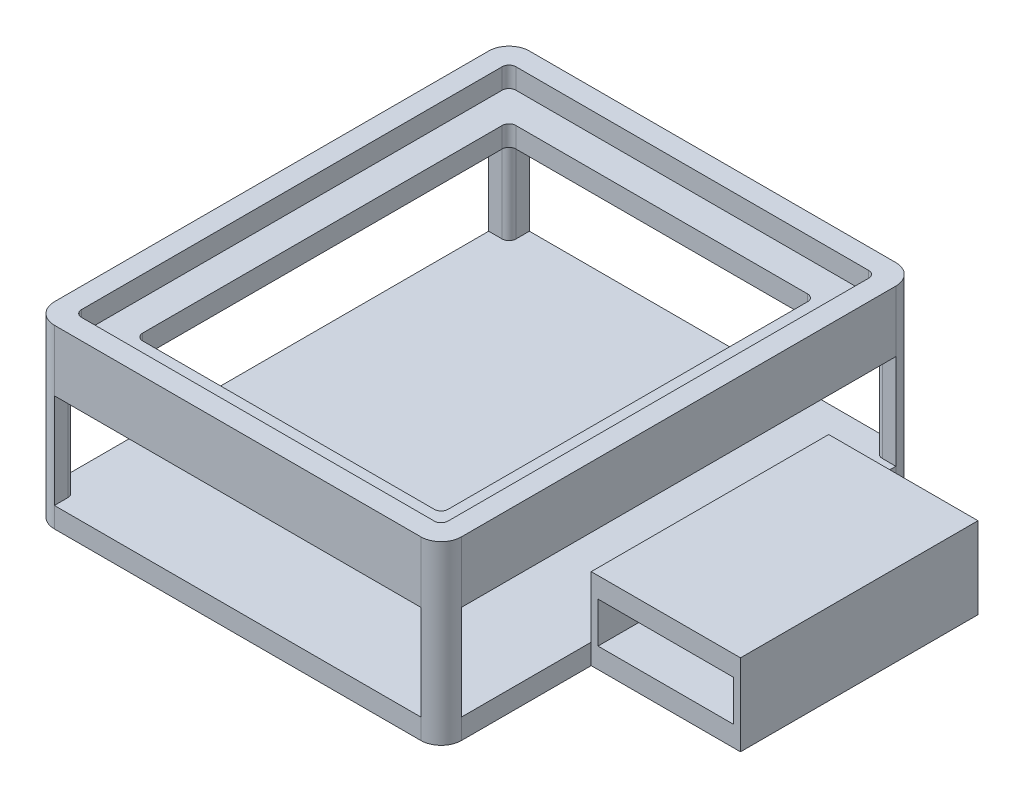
ISO-10303-21;
HEADER;
FILE_DESCRIPTION(('STEP AP214'),'2;1');
FILE_NAME('part.step','',(''),(''),'','','');
FILE_SCHEMA(('AUTOMOTIVE_DESIGN { 1 0 10303 214 1 1 1 1 }'));
ENDSEC;
DATA;
#1=APPLICATION_CONTEXT('core data for automotive mechanical design processes');
#2=APPLICATION_PROTOCOL_DEFINITION('international standard','automotive_design',2000,#1);
#3=PRODUCT_CONTEXT('',#1,'mechanical');
#4=PRODUCT('Part','Part','',(#3));
#5=PRODUCT_RELATED_PRODUCT_CATEGORY('part','',(#4));
#6=PRODUCT_DEFINITION_FORMATION('','',#4);
#7=PRODUCT_DEFINITION_CONTEXT('part definition',#1,'design');
#8=PRODUCT_DEFINITION('design','',#6,#7);
#9=PRODUCT_DEFINITION_SHAPE('','',#8);
#10=(LENGTH_UNIT() NAMED_UNIT(*) SI_UNIT(.MILLI.,.METRE.));
#11=(NAMED_UNIT(*) PLANE_ANGLE_UNIT() SI_UNIT($,.RADIAN.));
#12=(NAMED_UNIT(*) SI_UNIT($,.STERADIAN.) SOLID_ANGLE_UNIT());
#13=UNCERTAINTY_MEASURE_WITH_UNIT(LENGTH_MEASURE(1.E-05),#10,'distance_accuracy_value','');
#14=(GEOMETRIC_REPRESENTATION_CONTEXT(3) GLOBAL_UNCERTAINTY_ASSIGNED_CONTEXT((#13)) GLOBAL_UNIT_ASSIGNED_CONTEXT((#10,
#11,#12)) REPRESENTATION_CONTEXT('',''));
#15=CARTESIAN_POINT('',(0.,0.,0.));
#16=DIRECTION('',(0.,0.,1.));
#17=DIRECTION('',(1.,0.,0.));
#18=AXIS2_PLACEMENT_3D('',#15,#16,#17);
#19=CARTESIAN_POINT('',(0.,3.,0.));
#20=DIRECTION('',(0.,1.,0.));
#21=DIRECTION('',(0.,0.,1.));
#22=AXIS2_PLACEMENT_3D('',#19,#20,#21);
#23=PLANE('',#22);
#24=DIRECTION('',(0.,0.,1.));
#25=VECTOR('',#24,1.);
#26=CARTESIAN_POINT('',(25.8394160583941,3.,-13.8503649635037));
#27=LINE('',#26,#25);
#28=CARTESIAN_POINT('',(25.8394160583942,3.,34.0399066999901));
#29=VERTEX_POINT('',#28);
#30=CARTESIAN_POINT('',(25.8394160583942,3.,53.1496350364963));
#31=VERTEX_POINT('',#30);
#32=EDGE_CURVE('E525',#29,#31,#27,.T.);
#33=ORIENTED_EDGE('',*,*,#32,.F.);
#34=DIRECTION('',(0.,0.,1.));
#35=VECTOR('',#34,1.);
#36=CARTESIAN_POINT('',(25.8394160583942,3.,-0.960093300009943));
#37=LINE('',#36,#35);
#38=CARTESIAN_POINT('',(25.8394160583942,3.,-0.960093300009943));
#39=VERTEX_POINT('',#38);
#40=EDGE_CURVE('E407',#39,#29,#37,.T.);
#41=ORIENTED_EDGE('',*,*,#40,.F.);
#42=CARTESIAN_POINT('',(25.8394160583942,3.,-10.8503649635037));
#43=VERTEX_POINT('',#42);
#44=EDGE_CURVE('E526',#43,#39,#27,.T.);
#45=ORIENTED_EDGE('',*,*,#44,.F.);
#46=DIRECTION('',(-1.,0.,0.));
#47=VECTOR('',#46,1.);
#48=CARTESIAN_POINT('',(48.8394160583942,3.,-10.8503649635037));
#49=LINE('',#48,#47);
#50=CARTESIAN_POINT('',(23.8394160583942,3.,-10.8503649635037));
#51=VERTEX_POINT('',#50);
#52=EDGE_CURVE('E518',#43,#51,#49,.T.);
#53=ORIENTED_EDGE('',*,*,#52,.T.);
#54=CARTESIAN_POINT('',(23.8394160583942,3.,-11.8503649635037));
#55=DIRECTION('',(0.,1.,0.));
#56=DIRECTION('',(0.,0.,1.));
#57=AXIS2_PLACEMENT_3D('',#54,#55,#56);
#58=CIRCLE('',#57,1.);
#59=CARTESIAN_POINT('',(22.8394160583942,3.,-11.8503649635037));
#60=VERTEX_POINT('',#59);
#61=EDGE_CURVE('E781',#51,#60,#58,.F.);
#62=ORIENTED_EDGE('',*,*,#61,.T.);
#63=DIRECTION('',(0.,0.,1.));
#64=VECTOR('',#63,1.);
#65=CARTESIAN_POINT('',(22.8394160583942,3.,-26.8503649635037));
#66=LINE('',#65,#64);
#67=CARTESIAN_POINT('',(22.8394160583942,3.,-13.8503649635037));
#68=VERTEX_POINT('',#67);
#69=EDGE_CURVE('E553',#68,#60,#66,.T.);
#70=ORIENTED_EDGE('',*,*,#69,.F.);
#71=DIRECTION('',(1.,0.,0.));
#72=VECTOR('',#71,1.);
#73=CARTESIAN_POINT('',(-34.1605839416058,3.,-13.8503649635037));
#74=LINE('',#73,#72);
#75=CARTESIAN_POINT('',(-31.1605839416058,3.,-13.8503649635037));
#76=VERTEX_POINT('',#75);
#77=EDGE_CURVE('E559',#76,#68,#74,.T.);
#78=ORIENTED_EDGE('',*,*,#77,.F.);
#79=DIRECTION('',(0.,0.,1.));
#80=VECTOR('',#79,1.);
#81=CARTESIAN_POINT('',(-31.1605839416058,3.,-10.8503649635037));
#82=LINE('',#81,#80);
#83=CARTESIAN_POINT('',(-31.1605839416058,3.,-11.8503649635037));
#84=VERTEX_POINT('',#83);
#85=EDGE_CURVE('E574',#76,#84,#82,.T.);
#86=ORIENTED_EDGE('',*,*,#85,.T.);
#87=CARTESIAN_POINT('',(-32.1605839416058,3.,-11.8503649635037));
#88=DIRECTION('',(0.,1.,0.));
#89=DIRECTION('',(0.,0.,1.));
#90=AXIS2_PLACEMENT_3D('',#87,#88,#89);
#91=CIRCLE('',#90,1.);
#92=CARTESIAN_POINT('',(-32.1605839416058,3.,-10.8503649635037));
#93=VERTEX_POINT('',#92);
#94=EDGE_CURVE('E757',#84,#93,#91,.F.);
#95=ORIENTED_EDGE('',*,*,#94,.T.);
#96=CARTESIAN_POINT('',(-34.1605839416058,3.,-10.8503649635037));
#97=VERTEX_POINT('',#96);
#98=EDGE_CURVE('E508',#93,#97,#49,.T.);
#99=ORIENTED_EDGE('',*,*,#98,.T.);
#100=DIRECTION('',(0.,0.,1.));
#101=VECTOR('',#100,1.);
#102=CARTESIAN_POINT('',(-34.1605839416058,3.,-10.8503649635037));
#103=LINE('',#102,#101);
#104=CARTESIAN_POINT('',(-34.1605839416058,3.,53.1496350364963));
#105=VERTEX_POINT('',#104);
#106=EDGE_CURVE('E499',#97,#105,#103,.T.);
#107=ORIENTED_EDGE('',*,*,#106,.T.);
#108=DIRECTION('',(-1.,0.,0.));
#109=VECTOR('',#108,1.);
#110=CARTESIAN_POINT('',(48.8394160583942,3.,53.1496350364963));
#111=LINE('',#110,#109);
#112=CARTESIAN_POINT('',(-32.1605839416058,3.,53.1496350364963));
#113=VERTEX_POINT('',#112);
#114=EDGE_CURVE('E516',#113,#105,#111,.T.);
#115=ORIENTED_EDGE('',*,*,#114,.F.);
#116=CARTESIAN_POINT('',(-32.1605839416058,3.,54.1496350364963));
#117=DIRECTION('',(0.,1.,0.));
#118=DIRECTION('',(0.,0.,1.));
#119=AXIS2_PLACEMENT_3D('',#116,#117,#118);
#120=CIRCLE('',#119,1.);
#121=CARTESIAN_POINT('',(-31.1605839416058,3.,54.1496350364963));
#122=VERTEX_POINT('',#121);
#123=EDGE_CURVE('E774',#113,#122,#120,.F.);
#124=ORIENTED_EDGE('',*,*,#123,.T.);
#125=CARTESIAN_POINT('',(-31.1605839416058,3.,56.1496350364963));
#126=VERTEX_POINT('',#125);
#127=EDGE_CURVE('E569',#122,#126,#82,.T.);
#128=ORIENTED_EDGE('',*,*,#127,.T.);
#129=DIRECTION('',(1.,0.,0.));
#130=VECTOR('',#129,1.);
#131=CARTESIAN_POINT('',(-31.1605839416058,3.,56.1496350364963));
#132=LINE('',#131,#130);
#133=CARTESIAN_POINT('',(22.8394160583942,3.,56.1496350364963));
#134=VERTEX_POINT('',#133);
#135=EDGE_CURVE('E536',#126,#134,#132,.T.);
#136=ORIENTED_EDGE('',*,*,#135,.T.);
#137=CARTESIAN_POINT('',(22.8394160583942,3.,54.1496350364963));
#138=VERTEX_POINT('',#137);
#139=EDGE_CURVE('E545',#138,#134,#66,.T.);
#140=ORIENTED_EDGE('',*,*,#139,.F.);
#141=CARTESIAN_POINT('',(23.8394160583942,3.,54.1496350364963));
#142=DIRECTION('',(0.,1.,0.));
#143=DIRECTION('',(0.,0.,1.));
#144=AXIS2_PLACEMENT_3D('',#141,#142,#143);
#145=CIRCLE('',#144,1.);
#146=CARTESIAN_POINT('',(23.8394160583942,3.,53.1496350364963));
#147=VERTEX_POINT('',#146);
#148=EDGE_CURVE('E45',#138,#147,#145,.F.);
#149=ORIENTED_EDGE('',*,*,#148,.T.);
#150=EDGE_CURVE('E515',#31,#147,#111,.T.);
#151=ORIENTED_EDGE('',*,*,#150,.F.);
#152=EDGE_LOOP('',(#33,#41,#45,#53,#62,#70,#78,#86,#95,#99,#107,#115,#124,#128,#136,#140,#149,#151));
#153=FACE_BOUND('',#152,.T.);
#154=ADVANCED_FACE('F37',(#153),#23,.T.);
#155=CARTESIAN_POINT('',(25.8394160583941,3.,-13.8503649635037));
#156=DIRECTION('',(-1.,0.,0.));
#157=DIRECTION('',(0.,0.,1.));
#158=AXIS2_PLACEMENT_3D('',#155,#156,#157);
#159=PLANE('',#158);
#160=DIRECTION('',(0.,0.,-1.));
#161=VECTOR('',#160,1.);
#162=CARTESIAN_POINT('',(25.8394160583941,0.,-13.8503649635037));
#163=LINE('',#162,#161);
#164=CARTESIAN_POINT('',(25.8394160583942,0.,53.1496350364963));
#165=VERTEX_POINT('',#164);
#166=CARTESIAN_POINT('',(25.8394160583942,0.,34.0399066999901));
#167=VERTEX_POINT('',#166);
#168=EDGE_CURVE('E603',#165,#167,#163,.T.);
#169=ORIENTED_EDGE('',*,*,#168,.T.);
#170=DIRECTION('',(0.,-1.,0.));
#171=VECTOR('',#170,1.);
#172=CARTESIAN_POINT('',(25.8394160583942,3.,34.0399066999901));
#173=LINE('',#172,#171);
#174=EDGE_CURVE('E436',#29,#167,#173,.T.);
#175=ORIENTED_EDGE('',*,*,#174,.F.);
#176=ORIENTED_EDGE('',*,*,#32,.T.);
#177=DIRECTION('',(0.,-1.,0.));
#178=VECTOR('',#177,1.);
#179=CARTESIAN_POINT('',(25.8394160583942,3.,53.1496350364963));
#180=LINE('',#179,#178);
#181=EDGE_CURVE('E628',#31,#165,#180,.T.);
#182=ORIENTED_EDGE('',*,*,#181,.T.);
#183=EDGE_LOOP('',(#169,#175,#176,#182));
#184=FACE_BOUND('',#183,.T.);
#185=ADVANCED_FACE('F928',(#184),#159,.F.);
#186=ORIENTED_EDGE('',*,*,#44,.T.);
#187=DIRECTION('',(0.,-1.,0.));
#188=VECTOR('',#187,1.);
#189=CARTESIAN_POINT('',(25.8394160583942,3.,-0.960093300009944));
#190=LINE('',#189,#188);
#191=CARTESIAN_POINT('',(25.8394160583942,0.,-0.960093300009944));
#192=VERTEX_POINT('',#191);
#193=EDGE_CURVE('E60',#39,#192,#190,.T.);
#194=ORIENTED_EDGE('',*,*,#193,.T.);
#195=CARTESIAN_POINT('',(25.8394160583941,0.,-10.8503649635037));
#196=VERTEX_POINT('',#195);
#197=EDGE_CURVE('E602',#192,#196,#163,.T.);
#198=ORIENTED_EDGE('',*,*,#197,.T.);
#199=DIRECTION('',(0.,-1.,0.));
#200=VECTOR('',#199,1.);
#201=CARTESIAN_POINT('',(25.8394160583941,3.,-10.8503649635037));
#202=LINE('',#201,#200);
#203=EDGE_CURVE('E667',#196,#43,#202,.F.);
#204=ORIENTED_EDGE('',*,*,#203,.T.);
#205=EDGE_LOOP('',(#186,#194,#198,#204));
#206=FACE_BOUND('',#205,.T.);
#207=ADVANCED_FACE('F909',(#206),#159,.F.);
#208=CARTESIAN_POINT('',(-34.1605839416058,3.,-13.8503649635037));
#209=DIRECTION('',(0.,0.,1.));
#210=DIRECTION('',(1.,0.,0.));
#211=AXIS2_PLACEMENT_3D('',#208,#209,#210);
#212=PLANE('',#211);
#213=DIRECTION('',(-1.,0.,0.));
#214=VECTOR('',#213,1.);
#215=CARTESIAN_POINT('',(0.,26.,-13.8503649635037));
#216=LINE('',#215,#214);
#217=CARTESIAN_POINT('',(22.8394160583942,26.,-13.8503649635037));
#218=VERTEX_POINT('',#217);
#219=CARTESIAN_POINT('',(-31.1605839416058,26.,-13.8503649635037));
#220=VERTEX_POINT('',#219);
#221=EDGE_CURVE('E452',#218,#220,#216,.T.);
#222=ORIENTED_EDGE('',*,*,#221,.F.);
#223=DIRECTION('',(0.,-1.,0.));
#224=VECTOR('',#223,1.);
#225=CARTESIAN_POINT('',(22.8394160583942,3.,-13.8503649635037));
#226=LINE('',#225,#224);
#227=CARTESIAN_POINT('',(22.8394160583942,17.,-13.8503649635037));
#228=VERTEX_POINT('',#227);
#229=EDGE_CURVE('E659',#218,#228,#226,.T.);
#230=ORIENTED_EDGE('',*,*,#229,.T.);
#231=DIRECTION('',(-1.,0.,0.));
#232=VECTOR('',#231,1.);
#233=CARTESIAN_POINT('',(-34.1605839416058,17.,-13.8503649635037));
#234=LINE('',#233,#232);
#235=CARTESIAN_POINT('',(-31.1605839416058,17.,-13.8503649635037));
#236=VERTEX_POINT('',#235);
#237=EDGE_CURVE('E566',#228,#236,#234,.T.);
#238=ORIENTED_EDGE('',*,*,#237,.T.);
#239=DIRECTION('',(0.,-1.,0.));
#240=VECTOR('',#239,1.);
#241=CARTESIAN_POINT('',(-31.1605839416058,3.,-13.8503649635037));
#242=LINE('',#241,#240);
#243=EDGE_CURVE('E650',#236,#220,#242,.F.);
#244=ORIENTED_EDGE('',*,*,#243,.T.);
#245=EDGE_LOOP('',(#222,#230,#238,#244));
#246=FACE_BOUND('',#245,.T.);
#247=ADVANCED_FACE('F830',(#246),#212,.F.);
#248=CARTESIAN_POINT('',(-34.1605839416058,3.,-13.8503649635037));
#249=DIRECTION('',(1.,0.,0.));
#250=DIRECTION('',(0.,0.,-1.));
#251=AXIS2_PLACEMENT_3D('',#248,#249,#250);
#252=PLANE('',#251);
#253=DIRECTION('',(0.,0.,1.));
#254=VECTOR('',#253,1.);
#255=CARTESIAN_POINT('',(-34.1605839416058,26.,0.));
#256=LINE('',#255,#254);
#257=CARTESIAN_POINT('',(-34.1605839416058,26.,-10.8503649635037));
#258=VERTEX_POINT('',#257);
#259=CARTESIAN_POINT('',(-34.1605839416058,26.,53.1496350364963));
#260=VERTEX_POINT('',#259);
#261=EDGE_CURVE('E454',#258,#260,#256,.T.);
#262=ORIENTED_EDGE('',*,*,#261,.F.);
#263=DIRECTION('',(0.,-1.,0.));
#264=VECTOR('',#263,1.);
#265=CARTESIAN_POINT('',(-34.1605839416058,3.,-10.8503649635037));
#266=LINE('',#265,#264);
#267=CARTESIAN_POINT('',(-34.1605839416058,17.,-10.8503649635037));
#268=VERTEX_POINT('',#267);
#269=EDGE_CURVE('E644',#258,#268,#266,.T.);
#270=ORIENTED_EDGE('',*,*,#269,.T.);
#271=DIRECTION('',(0.,0.,-1.));
#272=VECTOR('',#271,1.);
#273=CARTESIAN_POINT('',(-34.1605839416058,17.,-10.8503649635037));
#274=LINE('',#273,#272);
#275=CARTESIAN_POINT('',(-34.1605839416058,17.,53.1496350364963));
#276=VERTEX_POINT('',#275);
#277=EDGE_CURVE('E505',#276,#268,#274,.T.);
#278=ORIENTED_EDGE('',*,*,#277,.F.);
#279=DIRECTION('',(0.,-1.,0.));
#280=VECTOR('',#279,1.);
#281=CARTESIAN_POINT('',(-34.1605839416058,3.,53.1496350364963));
#282=LINE('',#281,#280);
#283=EDGE_CURVE('E620',#276,#260,#282,.F.);
#284=ORIENTED_EDGE('',*,*,#283,.T.);
#285=EDGE_LOOP('',(#262,#270,#278,#284));
#286=FACE_BOUND('',#285,.T.);
#287=ADVANCED_FACE('F840',(#286),#252,.F.);
#288=CARTESIAN_POINT('',(-34.1605839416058,3.,56.1496350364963));
#289=DIRECTION('',(0.,0.,-1.));
#290=DIRECTION('',(-1.,0.,0.));
#291=AXIS2_PLACEMENT_3D('',#288,#289,#290);
#292=PLANE('',#291);
#293=DIRECTION('',(1.,0.,0.));
#294=VECTOR('',#293,1.);
#295=CARTESIAN_POINT('',(-34.1605839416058,0.,56.1496350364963));
#296=LINE('',#295,#294);
#297=CARTESIAN_POINT('',(-31.1605839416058,0.,56.1496350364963));
#298=VERTEX_POINT('',#297);
#299=CARTESIAN_POINT('',(22.8394160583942,0.,56.1496350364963));
#300=VERTEX_POINT('',#299);
#301=EDGE_CURVE('E599',#298,#300,#296,.T.);
#302=ORIENTED_EDGE('',*,*,#301,.T.);
#303=DIRECTION('',(0.,-1.,0.));
#304=VECTOR('',#303,1.);
#305=CARTESIAN_POINT('',(22.8394160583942,3.,56.1496350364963));
#306=LINE('',#305,#304);
#307=EDGE_CURVE('E637',#300,#134,#306,.F.);
#308=ORIENTED_EDGE('',*,*,#307,.T.);
#309=ORIENTED_EDGE('',*,*,#135,.F.);
#310=DIRECTION('',(0.,-1.,0.));
#311=VECTOR('',#310,1.);
#312=CARTESIAN_POINT('',(-31.1605839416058,3.,56.1496350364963));
#313=LINE('',#312,#311);
#314=EDGE_CURVE('E612',#126,#298,#313,.T.);
#315=ORIENTED_EDGE('',*,*,#314,.T.);
#316=EDGE_LOOP('',(#302,#308,#309,#315));
#317=FACE_BOUND('',#316,.T.);
#318=ADVANCED_FACE('F856',(#317),#292,.F.);
#319=CARTESIAN_POINT('',(0.,23.,0.));
#320=DIRECTION('',(0.,1.,0.));
#321=DIRECTION('',(0.,0.,1.));
#322=AXIS2_PLACEMENT_3D('',#319,#320,#321);
#323=PLANE('',#322);
#324=DIRECTION('',(0.,0.,1.));
#325=VECTOR('',#324,1.);
#326=CARTESIAN_POINT('',(-26.6605839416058,23.,-6.35036496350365));
#327=LINE('',#326,#325);
#328=CARTESIAN_POINT('',(-26.6605839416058,23.,-5.35036496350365));
#329=VERTEX_POINT('',#328);
#330=CARTESIAN_POINT('',(-26.6605839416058,23.,47.6496350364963));
#331=VERTEX_POINT('',#330);
#332=EDGE_CURVE('E467',#329,#331,#327,.T.);
#333=ORIENTED_EDGE('',*,*,#332,.F.);
#334=CARTESIAN_POINT('',(-25.6605839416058,23.,-5.35036496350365));
#335=DIRECTION('',(0.,1.,0.));
#336=DIRECTION('',(0.,0.,1.));
#337=AXIS2_PLACEMENT_3D('',#334,#335,#336);
#338=CIRCLE('',#337,1.);
#339=CARTESIAN_POINT('',(-25.6605839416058,23.,-6.35036496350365));
#340=VERTEX_POINT('',#339);
#341=EDGE_CURVE('E677',#329,#340,#338,.F.);
#342=ORIENTED_EDGE('',*,*,#341,.T.);
#343=DIRECTION('',(-1.,0.,0.));
#344=VECTOR('',#343,1.);
#345=CARTESIAN_POINT('',(-26.6605839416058,23.,-6.35036496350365));
#346=LINE('',#345,#344);
#347=CARTESIAN_POINT('',(17.3394160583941,23.,-6.35036496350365));
#348=VERTEX_POINT('',#347);
#349=EDGE_CURVE('E484',#348,#340,#346,.T.);
#350=ORIENTED_EDGE('',*,*,#349,.F.);
#351=CARTESIAN_POINT('',(17.3394160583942,23.,-5.35036496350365));
#352=DIRECTION('',(0.,1.,0.));
#353=DIRECTION('',(0.,0.,1.));
#354=AXIS2_PLACEMENT_3D('',#351,#352,#353);
#355=CIRCLE('',#354,1.);
#356=CARTESIAN_POINT('',(18.3394160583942,23.,-5.35036496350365));
#357=VERTEX_POINT('',#356);
#358=EDGE_CURVE('E699',#348,#357,#355,.F.);
#359=ORIENTED_EDGE('',*,*,#358,.T.);
#360=DIRECTION('',(0.,0.,-1.));
#361=VECTOR('',#360,1.);
#362=CARTESIAN_POINT('',(18.3394160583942,23.,-6.35036496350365));
#363=LINE('',#362,#361);
#364=CARTESIAN_POINT('',(18.3394160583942,23.,47.6496350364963));
#365=VERTEX_POINT('',#364);
#366=EDGE_CURVE('E482',#365,#357,#363,.T.);
#367=ORIENTED_EDGE('',*,*,#366,.F.);
#368=CARTESIAN_POINT('',(17.3394160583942,23.,47.6496350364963));
#369=DIRECTION('',(0.,1.,0.));
#370=DIRECTION('',(0.,0.,1.));
#371=AXIS2_PLACEMENT_3D('',#368,#369,#370);
#372=CIRCLE('',#371,1.);
#373=CARTESIAN_POINT('',(17.3394160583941,23.,48.6496350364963));
#374=VERTEX_POINT('',#373);
#375=EDGE_CURVE('E737',#365,#374,#372,.F.);
#376=ORIENTED_EDGE('',*,*,#375,.T.);
#377=DIRECTION('',(1.,0.,0.));
#378=VECTOR('',#377,1.);
#379=CARTESIAN_POINT('',(-26.6605839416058,23.,48.6496350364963));
#380=LINE('',#379,#378);
#381=CARTESIAN_POINT('',(-25.6605839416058,23.,48.6496350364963));
#382=VERTEX_POINT('',#381);
#383=EDGE_CURVE('E479',#382,#374,#380,.T.);
#384=ORIENTED_EDGE('',*,*,#383,.F.);
#385=CARTESIAN_POINT('',(-25.6605839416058,23.,47.6496350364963));
#386=DIRECTION('',(0.,1.,0.));
#387=DIRECTION('',(0.,0.,1.));
#388=AXIS2_PLACEMENT_3D('',#385,#386,#387);
#389=CIRCLE('',#388,1.);
#390=EDGE_CURVE('E745',#382,#331,#389,.F.);
#391=ORIENTED_EDGE('',*,*,#390,.T.);
#392=EDGE_LOOP('',(#333,#342,#350,#359,#367,#376,#384,#391));
#393=FACE_BOUND('',#392,.T.);
#394=DIRECTION('',(1.,0.,0.));
#395=VECTOR('',#394,1.);
#396=CARTESIAN_POINT('',(0.,23.,-10.8503649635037));
#397=LINE('',#396,#395);
#398=CARTESIAN_POINT('',(-30.1605839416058,23.,-10.8503649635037));
#399=VERTEX_POINT('',#398);
#400=CARTESIAN_POINT('',(21.8394160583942,23.,-10.8503649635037));
#401=VERTEX_POINT('',#400);
#402=EDGE_CURVE('E439',#399,#401,#397,.T.);
#403=ORIENTED_EDGE('',*,*,#402,.F.);
#404=CARTESIAN_POINT('',(-30.1605839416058,23.,-9.85036496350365));
#405=DIRECTION('',(0.,1.,0.));
#406=DIRECTION('',(0.,0.,1.));
#407=AXIS2_PLACEMENT_3D('',#404,#405,#406);
#408=CIRCLE('',#407,1.);
#409=CARTESIAN_POINT('',(-31.1605839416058,23.,-9.85036496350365));
#410=VERTEX_POINT('',#409);
#411=EDGE_CURVE('E711',#399,#410,#408,.T.);
#412=ORIENTED_EDGE('',*,*,#411,.T.);
#413=DIRECTION('',(0.,0.,1.));
#414=VECTOR('',#413,1.);
#415=CARTESIAN_POINT('',(-31.1605839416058,23.,0.));
#416=LINE('',#415,#414);
#417=CARTESIAN_POINT('',(-31.1605839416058,23.,52.1496350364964));
#418=VERTEX_POINT('',#417);
#419=EDGE_CURVE('E449',#410,#418,#416,.T.);
#420=ORIENTED_EDGE('',*,*,#419,.T.);
#421=CARTESIAN_POINT('',(-30.1605839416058,23.,52.1496350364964));
#422=DIRECTION('',(0.,1.,0.));
#423=DIRECTION('',(0.,0.,1.));
#424=AXIS2_PLACEMENT_3D('',#421,#422,#423);
#425=CIRCLE('',#424,1.);
#426=CARTESIAN_POINT('',(-30.1605839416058,23.,53.1496350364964));
#427=VERTEX_POINT('',#426);
#428=EDGE_CURVE('E707',#418,#427,#425,.T.);
#429=ORIENTED_EDGE('',*,*,#428,.T.);
#430=DIRECTION('',(1.,0.,0.));
#431=VECTOR('',#430,1.);
#432=CARTESIAN_POINT('',(0.,23.,53.1496350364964));
#433=LINE('',#432,#431);
#434=CARTESIAN_POINT('',(21.8394160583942,23.,53.1496350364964));
#435=VERTEX_POINT('',#434);
#436=EDGE_CURVE('E472',#427,#435,#433,.T.);
#437=ORIENTED_EDGE('',*,*,#436,.T.);
#438=CARTESIAN_POINT('',(21.8394160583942,23.,52.1496350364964));
#439=DIRECTION('',(0.,1.,0.));
#440=DIRECTION('',(0.,0.,1.));
#441=AXIS2_PLACEMENT_3D('',#438,#439,#440);
#442=CIRCLE('',#441,1.);
#443=CARTESIAN_POINT('',(22.8394160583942,23.,52.1496350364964));
#444=VERTEX_POINT('',#443);
#445=EDGE_CURVE('E709',#435,#444,#442,.T.);
#446=ORIENTED_EDGE('',*,*,#445,.T.);
#447=DIRECTION('',(0.,0.,1.));
#448=VECTOR('',#447,1.);
#449=CARTESIAN_POINT('',(22.8394160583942,23.,0.));
#450=LINE('',#449,#448);
#451=CARTESIAN_POINT('',(22.8394160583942,23.,-9.85036496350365));
#452=VERTEX_POINT('',#451);
#453=EDGE_CURVE('E469',#452,#444,#450,.T.);
#454=ORIENTED_EDGE('',*,*,#453,.F.);
#455=CARTESIAN_POINT('',(21.8394160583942,23.,-9.85036496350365));
#456=DIRECTION('',(0.,1.,0.));
#457=DIRECTION('',(0.,0.,1.));
#458=AXIS2_PLACEMENT_3D('',#455,#456,#457);
#459=CIRCLE('',#458,1.);
#460=EDGE_CURVE('E685',#452,#401,#459,.T.);
#461=ORIENTED_EDGE('',*,*,#460,.T.);
#462=EDGE_LOOP('',(#403,#412,#420,#429,#437,#446,#454,#461));
#463=FACE_BOUND('',#462,.T.);
#464=ADVANCED_FACE('F966',(#393,#463),#323,.T.);
#465=CARTESIAN_POINT('',(-31.1605839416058,20.,-10.8503649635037));
#466=DIRECTION('',(1.,0.,0.));
#467=DIRECTION('',(0.,0.,-1.));
#468=AXIS2_PLACEMENT_3D('',#465,#466,#467);
#469=PLANE('',#468);
#470=DIRECTION('',(0.,0.,1.));
#471=VECTOR('',#470,1.);
#472=CARTESIAN_POINT('',(-31.1605839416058,17.,-26.8503649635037));
#473=LINE('',#472,#471);
#474=CARTESIAN_POINT('',(-31.1605839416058,17.,-11.8503649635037));
#475=VERTEX_POINT('',#474);
#476=EDGE_CURVE('E548',#236,#475,#473,.T.);
#477=ORIENTED_EDGE('',*,*,#476,.T.);
#478=DIRECTION('',(0.,1.,0.));
#479=VECTOR('',#478,1.);
#480=CARTESIAN_POINT('',(-31.1605839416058,3.,-11.8503649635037));
#481=LINE('',#480,#479);
#482=EDGE_CURVE('E752',#475,#84,#481,.F.);
#483=ORIENTED_EDGE('',*,*,#482,.T.);
#484=ORIENTED_EDGE('',*,*,#85,.F.);
#485=DIRECTION('',(0.,-1.,0.));
#486=VECTOR('',#485,1.);
#487=CARTESIAN_POINT('',(-31.1605839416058,3.,-13.8503649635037));
#488=LINE('',#487,#486);
#489=EDGE_CURVE('E556',#236,#76,#488,.T.);
#490=ORIENTED_EDGE('',*,*,#489,.F.);
#491=EDGE_LOOP('',(#477,#483,#484,#490));
#492=FACE_BOUND('',#491,.T.);
#493=ADVANCED_FACE('F888',(#492),#469,.T.);
#494=DIRECTION('',(0.,0.,1.));
#495=VECTOR('',#494,1.);
#496=CARTESIAN_POINT('',(-31.1605839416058,17.,-10.8503649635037));
#497=LINE('',#496,#495);
#498=CARTESIAN_POINT('',(-31.1605839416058,17.,-10.8503649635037));
#499=VERTEX_POINT('',#498);
#500=CARTESIAN_POINT('',(-31.1605839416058,17.,53.1496350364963));
#501=VERTEX_POINT('',#500);
#502=EDGE_CURVE('E528',#499,#501,#497,.T.);
#503=ORIENTED_EDGE('',*,*,#502,.F.);
#504=DIRECTION('',(0.,-1.,0.));
#505=VECTOR('',#504,1.);
#506=CARTESIAN_POINT('',(-31.1605839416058,20.,-10.8503649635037));
#507=LINE('',#506,#505);
#508=CARTESIAN_POINT('',(-31.1605839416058,20.,-10.8503649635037));
#509=VERTEX_POINT('',#508);
#510=EDGE_CURVE('E583',#509,#499,#507,.T.);
#511=ORIENTED_EDGE('',*,*,#510,.F.);
#512=DIRECTION('',(0.,0.,1.));
#513=VECTOR('',#512,1.);
#514=CARTESIAN_POINT('',(-31.1605839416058,20.,-10.8503649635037));
#515=LINE('',#514,#513);
#516=CARTESIAN_POINT('',(-31.1605839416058,20.,53.1496350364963));
#517=VERTEX_POINT('',#516);
#518=EDGE_CURVE('E570',#509,#517,#515,.T.);
#519=ORIENTED_EDGE('',*,*,#518,.T.);
#520=DIRECTION('',(0.,-1.,0.));
#521=VECTOR('',#520,1.);
#522=CARTESIAN_POINT('',(-31.1605839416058,20.,53.1496350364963));
#523=LINE('',#522,#521);
#524=EDGE_CURVE('E594',#517,#501,#523,.T.);
#525=ORIENTED_EDGE('',*,*,#524,.T.);
#526=EDGE_LOOP('',(#503,#511,#519,#525));
#527=FACE_BOUND('',#526,.T.);
#528=ADVANCED_FACE('F940',(#527),#469,.T.);
#529=CARTESIAN_POINT('',(22.8394160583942,17.,-26.8503649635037));
#530=DIRECTION('',(1.,0.,0.));
#531=DIRECTION('',(0.,1.,0.));
#532=AXIS2_PLACEMENT_3D('',#529,#530,#531);
#533=PLANE('',#532);
#534=ORIENTED_EDGE('',*,*,#69,.T.);
#535=DIRECTION('',(0.,1.,0.));
#536=VECTOR('',#535,1.);
#537=CARTESIAN_POINT('',(22.8394160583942,17.,-11.8503649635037));
#538=LINE('',#537,#536);
#539=CARTESIAN_POINT('',(22.8394160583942,17.,-11.8503649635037));
#540=VERTEX_POINT('',#539);
#541=EDGE_CURVE('E764',#60,#540,#538,.T.);
#542=ORIENTED_EDGE('',*,*,#541,.T.);
#543=DIRECTION('',(0.,0.,1.));
#544=VECTOR('',#543,1.);
#545=CARTESIAN_POINT('',(22.8394160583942,17.,-26.8503649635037));
#546=LINE('',#545,#544);
#547=EDGE_CURVE('E549',#228,#540,#546,.T.);
#548=ORIENTED_EDGE('',*,*,#547,.F.);
#549=DIRECTION('',(0.,1.,0.));
#550=VECTOR('',#549,1.);
#551=CARTESIAN_POINT('',(22.8394160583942,3.00000000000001,-13.8503649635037));
#552=LINE('',#551,#550);
#553=EDGE_CURVE('E610',#68,#228,#552,.T.);
#554=ORIENTED_EDGE('',*,*,#553,.F.);
#555=EDGE_LOOP('',(#534,#542,#548,#554));
#556=FACE_BOUND('',#555,.T.);
#557=ADVANCED_FACE('F895',(#556),#533,.F.);
#558=ORIENTED_EDGE('',*,*,#106,.F.);
#559=DIRECTION('',(0.,-1.,0.));
#560=VECTOR('',#559,1.);
#561=CARTESIAN_POINT('',(-34.1605839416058,3.,-10.8503649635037));
#562=LINE('',#561,#560);
#563=CARTESIAN_POINT('',(-34.1605839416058,0.,-10.8503649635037));
#564=VERTEX_POINT('',#563);
#565=EDGE_CURVE('E642',#97,#564,#562,.T.);
#566=ORIENTED_EDGE('',*,*,#565,.T.);
#567=DIRECTION('',(0.,0.,1.));
#568=VECTOR('',#567,1.);
#569=CARTESIAN_POINT('',(-34.1605839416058,0.,-13.8503649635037));
#570=LINE('',#569,#568);
#571=CARTESIAN_POINT('',(-34.1605839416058,0.,53.1496350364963));
#572=VERTEX_POINT('',#571);
#573=EDGE_CURVE('E597',#564,#572,#570,.T.);
#574=ORIENTED_EDGE('',*,*,#573,.T.);
#575=DIRECTION('',(0.,-1.,0.));
#576=VECTOR('',#575,1.);
#577=CARTESIAN_POINT('',(-34.1605839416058,3.,53.1496350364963));
#578=LINE('',#577,#576);
#579=EDGE_CURVE('E623',#572,#105,#578,.F.);
#580=ORIENTED_EDGE('',*,*,#579,.T.);
#581=EDGE_LOOP('',(#558,#566,#574,#580));
#582=FACE_BOUND('',#581,.T.);
#583=ADVANCED_FACE('F878',(#582),#252,.F.);
#584=DIRECTION('',(-1.,0.,0.));
#585=VECTOR('',#584,1.);
#586=CARTESIAN_POINT('',(-31.1605839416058,17.,56.1496350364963));
#587=LINE('',#586,#585);
#588=CARTESIAN_POINT('',(22.8394160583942,17.,56.1496350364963));
#589=VERTEX_POINT('',#588);
#590=CARTESIAN_POINT('',(-31.1605839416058,17.,56.1496350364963));
#591=VERTEX_POINT('',#590);
#592=EDGE_CURVE('E542',#589,#591,#587,.T.);
#593=ORIENTED_EDGE('',*,*,#592,.F.);
#594=DIRECTION('',(0.,-1.,0.));
#595=VECTOR('',#594,1.);
#596=CARTESIAN_POINT('',(22.8394160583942,3.,56.1496350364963));
#597=LINE('',#596,#595);
#598=CARTESIAN_POINT('',(22.8394160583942,26.,56.1496350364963));
#599=VERTEX_POINT('',#598);
#600=EDGE_CURVE('E635',#589,#599,#597,.F.);
#601=ORIENTED_EDGE('',*,*,#600,.T.);
#602=DIRECTION('',(1.,0.,0.));
#603=VECTOR('',#602,1.);
#604=CARTESIAN_POINT('',(0.,26.,56.1496350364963));
#605=LINE('',#604,#603);
#606=CARTESIAN_POINT('',(-31.1605839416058,26.,56.1496350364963));
#607=VERTEX_POINT('',#606);
#608=EDGE_CURVE('E445',#607,#599,#605,.T.);
#609=ORIENTED_EDGE('',*,*,#608,.F.);
#610=DIRECTION('',(0.,-1.,0.));
#611=VECTOR('',#610,1.);
#612=CARTESIAN_POINT('',(-31.1605839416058,3.,56.1496350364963));
#613=LINE('',#612,#611);
#614=EDGE_CURVE('E614',#607,#591,#613,.T.);
#615=ORIENTED_EDGE('',*,*,#614,.T.);
#616=EDGE_LOOP('',(#593,#601,#609,#615));
#617=FACE_BOUND('',#616,.T.);
#618=ADVANCED_FACE('F809',(#617),#292,.F.);
#619=DIRECTION('',(0.,0.,-1.));
#620=VECTOR('',#619,1.);
#621=CARTESIAN_POINT('',(25.8394160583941,17.,-13.8503649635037));
#622=LINE('',#621,#620);
#623=CARTESIAN_POINT('',(25.8394160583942,17.,53.1496350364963));
#624=VERTEX_POINT('',#623);
#625=CARTESIAN_POINT('',(25.8394160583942,17.,-10.8503649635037));
#626=VERTEX_POINT('',#625);
#627=EDGE_CURVE('E530',#624,#626,#622,.T.);
#628=ORIENTED_EDGE('',*,*,#627,.T.);
#629=DIRECTION('',(0.,-1.,0.));
#630=VECTOR('',#629,1.);
#631=CARTESIAN_POINT('',(25.8394160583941,3.,-10.8503649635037));
#632=LINE('',#631,#630);
#633=CARTESIAN_POINT('',(25.8394160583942,26.,-10.8503649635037));
#634=VERTEX_POINT('',#633);
#635=EDGE_CURVE('E665',#626,#634,#632,.F.);
#636=ORIENTED_EDGE('',*,*,#635,.T.);
#637=DIRECTION('',(0.,0.,-1.));
#638=VECTOR('',#637,1.);
#639=CARTESIAN_POINT('',(25.8394160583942,26.,0.));
#640=LINE('',#639,#638);
#641=CARTESIAN_POINT('',(25.8394160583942,26.,53.1496350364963));
#642=VERTEX_POINT('',#641);
#643=EDGE_CURVE('E448',#642,#634,#640,.T.);
#644=ORIENTED_EDGE('',*,*,#643,.F.);
#645=DIRECTION('',(0.,-1.,0.));
#646=VECTOR('',#645,1.);
#647=CARTESIAN_POINT('',(25.8394160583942,3.,53.1496350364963));
#648=LINE('',#647,#646);
#649=EDGE_CURVE('E630',#642,#624,#648,.T.);
#650=ORIENTED_EDGE('',*,*,#649,.T.);
#651=EDGE_LOOP('',(#628,#636,#644,#650));
#652=FACE_BOUND('',#651,.T.);
#653=ADVANCED_FACE('F822',(#652),#159,.F.);
#654=ORIENTED_EDGE('',*,*,#77,.T.);
#655=DIRECTION('',(0.,-1.,0.));
#656=VECTOR('',#655,1.);
#657=CARTESIAN_POINT('',(22.8394160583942,3.,-13.8503649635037));
#658=LINE('',#657,#656);
#659=CARTESIAN_POINT('',(22.8394160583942,0.,-13.8503649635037));
#660=VERTEX_POINT('',#659);
#661=EDGE_CURVE('E657',#68,#660,#658,.T.);
#662=ORIENTED_EDGE('',*,*,#661,.T.);
#663=DIRECTION('',(-1.,0.,0.));
#664=VECTOR('',#663,1.);
#665=CARTESIAN_POINT('',(-34.1605839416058,0.,-13.8503649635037));
#666=LINE('',#665,#664);
#667=CARTESIAN_POINT('',(-31.1605839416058,0.,-13.8503649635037));
#668=VERTEX_POINT('',#667);
#669=EDGE_CURVE('E605',#660,#668,#666,.T.);
#670=ORIENTED_EDGE('',*,*,#669,.T.);
#671=DIRECTION('',(0.,-1.,0.));
#672=VECTOR('',#671,1.);
#673=CARTESIAN_POINT('',(-31.1605839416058,3.,-13.8503649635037));
#674=LINE('',#673,#672);
#675=EDGE_CURVE('E653',#668,#76,#674,.F.);
#676=ORIENTED_EDGE('',*,*,#675,.T.);
#677=EDGE_LOOP('',(#654,#662,#670,#676));
#678=FACE_BOUND('',#677,.T.);
#679=ADVANCED_FACE('F919',(#678),#212,.F.);
#680=CARTESIAN_POINT('',(0.,0.,0.));
#681=DIRECTION('',(0.,1.,0.));
#682=DIRECTION('',(0.,0.,1.));
#683=AXIS2_PLACEMENT_3D('',#680,#681,#682);
#684=PLANE('',#683);
#685=ORIENTED_EDGE('',*,*,#669,.F.);
#686=CARTESIAN_POINT('',(22.8394160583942,0.,-10.8503649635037));
#687=DIRECTION('',(0.,1.,0.));
#688=DIRECTION('',(0.,0.,1.));
#689=AXIS2_PLACEMENT_3D('',#686,#687,#688);
#690=CIRCLE('',#689,3.);
#691=EDGE_CURVE('E662',#660,#196,#690,.F.);
#692=ORIENTED_EDGE('',*,*,#691,.T.);
#693=ORIENTED_EDGE('',*,*,#197,.F.);
#694=DIRECTION('',(1.,0.,0.));
#695=VECTOR('',#694,1.);
#696=CARTESIAN_POINT('',(25.8394160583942,0.,-0.960093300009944));
#697=LINE('',#696,#695);
#698=CARTESIAN_POINT('',(47.8394160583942,0.,-0.960093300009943));
#699=VERTEX_POINT('',#698);
#700=EDGE_CURVE('E427',#192,#699,#697,.T.);
#701=ORIENTED_EDGE('',*,*,#700,.T.);
#702=DIRECTION('',(0.,0.,1.));
#703=VECTOR('',#702,1.);
#704=CARTESIAN_POINT('',(47.8394160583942,0.,34.0399066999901));
#705=LINE('',#704,#703);
#706=CARTESIAN_POINT('',(47.8394160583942,0.,34.0399066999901));
#707=VERTEX_POINT('',#706);
#708=EDGE_CURVE('E430',#699,#707,#705,.T.);
#709=ORIENTED_EDGE('',*,*,#708,.T.);
#710=DIRECTION('',(-1.,0.,0.));
#711=VECTOR('',#710,1.);
#712=CARTESIAN_POINT('',(25.8394160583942,0.,34.0399066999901));
#713=LINE('',#712,#711);
#714=EDGE_CURVE('E433',#707,#167,#713,.T.);
#715=ORIENTED_EDGE('',*,*,#714,.T.);
#716=ORIENTED_EDGE('',*,*,#168,.F.);
#717=CARTESIAN_POINT('',(22.8394160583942,0.,53.1496350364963));
#718=DIRECTION('',(0.,1.,0.));
#719=DIRECTION('',(0.,0.,1.));
#720=AXIS2_PLACEMENT_3D('',#717,#718,#719);
#721=CIRCLE('',#720,3.);
#722=EDGE_CURVE('E633',#165,#300,#721,.F.);
#723=ORIENTED_EDGE('',*,*,#722,.T.);
#724=ORIENTED_EDGE('',*,*,#301,.F.);
#725=CARTESIAN_POINT('',(-31.1605839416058,0.,53.1496350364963));
#726=DIRECTION('',(0.,1.,0.));
#727=DIRECTION('',(0.,0.,1.));
#728=AXIS2_PLACEMENT_3D('',#725,#726,#727);
#729=CIRCLE('',#728,3.);
#730=EDGE_CURVE('E617',#298,#572,#729,.F.);
#731=ORIENTED_EDGE('',*,*,#730,.T.);
#732=ORIENTED_EDGE('',*,*,#573,.F.);
#733=CARTESIAN_POINT('',(-31.1605839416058,0.,-10.8503649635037));
#734=DIRECTION('',(0.,1.,0.));
#735=DIRECTION('',(0.,0.,1.));
#736=AXIS2_PLACEMENT_3D('',#733,#734,#735);
#737=CIRCLE('',#736,3.);
#738=EDGE_CURVE('E647',#564,#668,#737,.F.);
#739=ORIENTED_EDGE('',*,*,#738,.T.);
#740=EDGE_LOOP('',(#685,#692,#693,#701,#709,#715,#716,#723,#724,#731,#732,#739));
#741=FACE_BOUND('',#740,.T.);
#742=ADVANCED_FACE('F881',(#741),#684,.F.);
#743=ORIENTED_EDGE('',*,*,#127,.F.);
#744=DIRECTION('',(0.,-1.,0.));
#745=VECTOR('',#744,1.);
#746=CARTESIAN_POINT('',(-31.1605839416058,17.,54.1496350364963));
#747=LINE('',#746,#745);
#748=CARTESIAN_POINT('',(-31.1605839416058,17.,54.1496350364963));
#749=VERTEX_POINT('',#748);
#750=EDGE_CURVE('E762',#122,#749,#747,.F.);
#751=ORIENTED_EDGE('',*,*,#750,.T.);
#752=EDGE_CURVE('E546',#749,#591,#473,.T.);
#753=ORIENTED_EDGE('',*,*,#752,.T.);
#754=DIRECTION('',(0.,-1.,0.));
#755=VECTOR('',#754,1.);
#756=CARTESIAN_POINT('',(-31.1605839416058,17.,56.1496350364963));
#757=LINE('',#756,#755);
#758=EDGE_CURVE('E533',#591,#126,#757,.T.);
#759=ORIENTED_EDGE('',*,*,#758,.T.);
#760=EDGE_LOOP('',(#743,#751,#753,#759));
#761=FACE_BOUND('',#760,.T.);
#762=ADVANCED_FACE('F853',(#761),#469,.T.);
#763=CARTESIAN_POINT('',(-31.1605839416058,20.,53.1496350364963));
#764=DIRECTION('',(0.,0.,-1.));
#765=DIRECTION('',(-1.,0.,0.));
#766=AXIS2_PLACEMENT_3D('',#763,#764,#765);
#767=PLANE('',#766);
#768=DIRECTION('',(1.,0.,0.));
#769=VECTOR('',#768,1.);
#770=CARTESIAN_POINT('',(-31.1605839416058,17.,53.1496350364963));
#771=LINE('',#770,#769);
#772=CARTESIAN_POINT('',(22.4181410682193,17.,53.1496350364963));
#773=VERTEX_POINT('',#772);
#774=EDGE_CURVE('E564',#501,#773,#771,.T.);
#775=ORIENTED_EDGE('',*,*,#774,.F.);
#776=ORIENTED_EDGE('',*,*,#524,.F.);
#777=DIRECTION('',(1.,0.,0.));
#778=VECTOR('',#777,1.);
#779=CARTESIAN_POINT('',(-31.1605839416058,20.,53.1496350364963));
#780=LINE('',#779,#778);
#781=CARTESIAN_POINT('',(22.4181410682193,20.,53.1496350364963));
#782=VERTEX_POINT('',#781);
#783=EDGE_CURVE('E573',#517,#782,#780,.T.);
#784=ORIENTED_EDGE('',*,*,#783,.T.);
#785=DIRECTION('',(0.,-1.,0.));
#786=VECTOR('',#785,1.);
#787=CARTESIAN_POINT('',(22.4181410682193,20.,53.1496350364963));
#788=LINE('',#787,#786);
#789=EDGE_CURVE('E591',#782,#773,#788,.T.);
#790=ORIENTED_EDGE('',*,*,#789,.T.);
#791=EDGE_LOOP('',(#775,#776,#784,#790));
#792=FACE_BOUND('',#791,.T.);
#793=ADVANCED_FACE('F939',(#792),#767,.T.);
#794=CARTESIAN_POINT('',(22.4181410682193,20.,-10.8503649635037));
#795=DIRECTION('',(-1.,0.,0.));
#796=DIRECTION('',(0.,0.,1.));
#797=AXIS2_PLACEMENT_3D('',#794,#795,#796);
#798=PLANE('',#797);
#799=DIRECTION('',(0.,0.,-1.));
#800=VECTOR('',#799,1.);
#801=CARTESIAN_POINT('',(22.4181410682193,17.,-10.8503649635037));
#802=LINE('',#801,#800);
#803=CARTESIAN_POINT('',(22.4181410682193,17.,-10.8503649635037));
#804=VERTEX_POINT('',#803);
#805=EDGE_CURVE('E562',#773,#804,#802,.T.);
#806=ORIENTED_EDGE('',*,*,#805,.F.);
#807=ORIENTED_EDGE('',*,*,#789,.F.);
#808=DIRECTION('',(0.,0.,-1.));
#809=VECTOR('',#808,1.);
#810=CARTESIAN_POINT('',(22.4181410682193,20.,-10.8503649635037));
#811=LINE('',#810,#809);
#812=CARTESIAN_POINT('',(22.4181410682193,20.,-10.8503649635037));
#813=VERTEX_POINT('',#812);
#814=EDGE_CURVE('E577',#782,#813,#811,.T.);
#815=ORIENTED_EDGE('',*,*,#814,.T.);
#816=DIRECTION('',(0.,-1.,0.));
#817=VECTOR('',#816,1.);
#818=CARTESIAN_POINT('',(22.4181410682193,20.,-10.8503649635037));
#819=LINE('',#818,#817);
#820=EDGE_CURVE('E588',#813,#804,#819,.T.);
#821=ORIENTED_EDGE('',*,*,#820,.T.);
#822=EDGE_LOOP('',(#806,#807,#815,#821));
#823=FACE_BOUND('',#822,.T.);
#824=ADVANCED_FACE('F943',(#823),#798,.T.);
#825=CARTESIAN_POINT('',(-31.1605839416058,20.,-10.8503649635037));
#826=DIRECTION('',(0.,0.,1.));
#827=DIRECTION('',(1.,0.,0.));
#828=AXIS2_PLACEMENT_3D('',#825,#826,#827);
#829=PLANE('',#828);
#830=DIRECTION('',(-1.,0.,0.));
#831=VECTOR('',#830,1.);
#832=CARTESIAN_POINT('',(-31.1605839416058,17.,-10.8503649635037));
#833=LINE('',#832,#831);
#834=EDGE_CURVE('E607',#804,#499,#833,.T.);
#835=ORIENTED_EDGE('',*,*,#834,.F.);
#836=ORIENTED_EDGE('',*,*,#820,.F.);
#837=DIRECTION('',(-1.,0.,0.));
#838=VECTOR('',#837,1.);
#839=CARTESIAN_POINT('',(-31.1605839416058,20.,-10.8503649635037));
#840=LINE('',#839,#838);
#841=EDGE_CURVE('E580',#813,#509,#840,.T.);
#842=ORIENTED_EDGE('',*,*,#841,.T.);
#843=ORIENTED_EDGE('',*,*,#510,.T.);
#844=EDGE_LOOP('',(#835,#836,#842,#843));
#845=FACE_BOUND('',#844,.T.);
#846=ADVANCED_FACE('F947',(#845),#829,.T.);
#847=CARTESIAN_POINT('',(22.8394160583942,17.,54.1496350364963));
#848=VERTEX_POINT('',#847);
#849=EDGE_CURVE('E552',#848,#589,#546,.T.);
#850=ORIENTED_EDGE('',*,*,#849,.F.);
#851=DIRECTION('',(0.,-1.,0.));
#852=VECTOR('',#851,1.);
#853=CARTESIAN_POINT('',(22.8394160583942,17.,54.1496350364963));
#854=LINE('',#853,#852);
#855=EDGE_CURVE('E769',#848,#138,#854,.T.);
#856=ORIENTED_EDGE('',*,*,#855,.T.);
#857=ORIENTED_EDGE('',*,*,#139,.T.);
#858=DIRECTION('',(0.,1.,0.));
#859=VECTOR('',#858,1.);
#860=CARTESIAN_POINT('',(22.8394160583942,17.,56.1496350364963));
#861=LINE('',#860,#859);
#862=EDGE_CURVE('E539',#134,#589,#861,.T.);
#863=ORIENTED_EDGE('',*,*,#862,.T.);
#864=EDGE_LOOP('',(#850,#856,#857,#863));
#865=FACE_BOUND('',#864,.T.);
#866=ADVANCED_FACE('F802',(#865),#533,.F.);
#867=CARTESIAN_POINT('',(48.8394160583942,17.,53.1496350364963));
#868=DIRECTION('',(0.,0.,1.));
#869=DIRECTION('',(1.,0.,0.));
#870=AXIS2_PLACEMENT_3D('',#867,#868,#869);
#871=PLANE('',#870);
#872=ORIENTED_EDGE('',*,*,#150,.T.);
#873=DIRECTION('',(0.,-1.,0.));
#874=VECTOR('',#873,1.);
#875=CARTESIAN_POINT('',(23.8394160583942,17.,53.1496350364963));
#876=LINE('',#875,#874);
#877=CARTESIAN_POINT('',(23.8394160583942,17.,53.1496350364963));
#878=VERTEX_POINT('',#877);
#879=EDGE_CURVE('E772',#147,#878,#876,.F.);
#880=ORIENTED_EDGE('',*,*,#879,.T.);
#881=DIRECTION('',(-1.,0.,0.));
#882=VECTOR('',#881,1.);
#883=CARTESIAN_POINT('',(48.8394160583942,17.,53.1496350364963));
#884=LINE('',#883,#882);
#885=EDGE_CURVE('E512',#624,#878,#884,.T.);
#886=ORIENTED_EDGE('',*,*,#885,.F.);
#887=DIRECTION('',(0.,1.,0.));
#888=VECTOR('',#887,1.);
#889=CARTESIAN_POINT('',(25.8394160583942,3.,53.1496350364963));
#890=LINE('',#889,#888);
#891=EDGE_CURVE('E520',#31,#624,#890,.T.);
#892=ORIENTED_EDGE('',*,*,#891,.F.);
#893=EDGE_LOOP('',(#872,#880,#886,#892));
#894=FACE_BOUND('',#893,.T.);
#895=ADVANCED_FACE('F792',(#894),#871,.F.);
#896=CARTESIAN_POINT('',(48.8394160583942,17.,-10.8503649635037));
#897=DIRECTION('',(0.,0.,-1.));
#898=DIRECTION('',(-1.,0.,0.));
#899=AXIS2_PLACEMENT_3D('',#896,#897,#898);
#900=PLANE('',#899);
#901=DIRECTION('',(-1.,0.,0.));
#902=VECTOR('',#901,1.);
#903=CARTESIAN_POINT('',(48.8394160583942,17.,-10.8503649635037));
#904=LINE('',#903,#902);
#905=CARTESIAN_POINT('',(23.8394160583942,17.,-10.8503649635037));
#906=VERTEX_POINT('',#905);
#907=EDGE_CURVE('E511',#626,#906,#904,.T.);
#908=ORIENTED_EDGE('',*,*,#907,.T.);
#909=DIRECTION('',(0.,1.,0.));
#910=VECTOR('',#909,1.);
#911=CARTESIAN_POINT('',(23.8394160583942,17.,-10.8503649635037));
#912=LINE('',#911,#910);
#913=EDGE_CURVE('E767',#906,#51,#912,.F.);
#914=ORIENTED_EDGE('',*,*,#913,.T.);
#915=ORIENTED_EDGE('',*,*,#52,.F.);
#916=DIRECTION('',(0.,-1.,0.));
#917=VECTOR('',#916,1.);
#918=CARTESIAN_POINT('',(25.8394160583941,3.,-10.8503649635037));
#919=LINE('',#918,#917);
#920=EDGE_CURVE('E522',#626,#43,#919,.T.);
#921=ORIENTED_EDGE('',*,*,#920,.F.);
#922=EDGE_LOOP('',(#908,#914,#915,#921));
#923=FACE_BOUND('',#922,.T.);
#924=ADVANCED_FACE('F904',(#923),#900,.F.);
#925=CARTESIAN_POINT('',(48.8394160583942,17.,-10.8503649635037));
#926=DIRECTION('',(0.,1.,0.));
#927=DIRECTION('',(0.,0.,1.));
#928=AXIS2_PLACEMENT_3D('',#925,#926,#927);
#929=PLANE('',#928);
#930=ORIENTED_EDGE('',*,*,#502,.T.);
#931=ORIENTED_EDGE('',*,*,#774,.T.);
#932=ORIENTED_EDGE('',*,*,#805,.T.);
#933=ORIENTED_EDGE('',*,*,#834,.T.);
#934=EDGE_LOOP('',(#930,#931,#932,#933));
#935=FACE_BOUND('',#934,.T.);
#936=CARTESIAN_POINT('',(-32.1605839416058,17.,54.1496350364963));
#937=DIRECTION('',(0.,1.,0.));
#938=DIRECTION('',(0.,0.,1.));
#939=AXIS2_PLACEMENT_3D('',#936,#937,#938);
#940=CIRCLE('',#939,1.);
#941=CARTESIAN_POINT('',(-32.1605839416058,17.,53.1496350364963));
#942=VERTEX_POINT('',#941);
#943=EDGE_CURVE('E776',#749,#942,#940,.T.);
#944=ORIENTED_EDGE('',*,*,#943,.T.);
#945=EDGE_CURVE('E513',#942,#276,#884,.T.);
#946=ORIENTED_EDGE('',*,*,#945,.T.);
#947=ORIENTED_EDGE('',*,*,#277,.T.);
#948=CARTESIAN_POINT('',(-32.1605839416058,17.,-10.8503649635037));
#949=VERTEX_POINT('',#948);
#950=EDGE_CURVE('E509',#949,#268,#904,.T.);
#951=ORIENTED_EDGE('',*,*,#950,.F.);
#952=CARTESIAN_POINT('',(-32.1605839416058,17.,-11.8503649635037));
#953=DIRECTION('',(0.,1.,0.));
#954=DIRECTION('',(0.,0.,1.));
#955=AXIS2_PLACEMENT_3D('',#952,#953,#954);
#956=CIRCLE('',#955,1.);
#957=EDGE_CURVE('E754',#949,#475,#956,.T.);
#958=ORIENTED_EDGE('',*,*,#957,.T.);
#959=ORIENTED_EDGE('',*,*,#476,.F.);
#960=ORIENTED_EDGE('',*,*,#237,.F.);
#961=ORIENTED_EDGE('',*,*,#547,.T.);
#962=CARTESIAN_POINT('',(23.8394160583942,17.,-11.8503649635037));
#963=DIRECTION('',(0.,1.,0.));
#964=DIRECTION('',(0.,0.,1.));
#965=AXIS2_PLACEMENT_3D('',#962,#963,#964);
#966=CIRCLE('',#965,1.);
#967=EDGE_CURVE('E779',#540,#906,#966,.T.);
#968=ORIENTED_EDGE('',*,*,#967,.T.);
#969=ORIENTED_EDGE('',*,*,#907,.F.);
#970=ORIENTED_EDGE('',*,*,#627,.F.);
#971=ORIENTED_EDGE('',*,*,#885,.T.);
#972=CARTESIAN_POINT('',(23.8394160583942,17.,54.1496350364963));
#973=DIRECTION('',(0.,1.,0.));
#974=DIRECTION('',(0.,0.,1.));
#975=AXIS2_PLACEMENT_3D('',#972,#973,#974);
#976=CIRCLE('',#975,1.);
#977=EDGE_CURVE('E11',#878,#848,#976,.T.);
#978=ORIENTED_EDGE('',*,*,#977,.T.);
#979=ORIENTED_EDGE('',*,*,#849,.T.);
#980=ORIENTED_EDGE('',*,*,#592,.T.);
#981=ORIENTED_EDGE('',*,*,#752,.F.);
#982=EDGE_LOOP('',(#944,#946,#947,#951,#958,#959,#960,#961,#968,#969,#970,#971,#978,#979,#980,#981));
#983=FACE_BOUND('',#982,.T.);
#984=ADVANCED_FACE('F799',(#935,#983),#929,.F.);
#985=ORIENTED_EDGE('',*,*,#98,.F.);
#986=DIRECTION('',(0.,1.,0.));
#987=VECTOR('',#986,1.);
#988=CARTESIAN_POINT('',(-32.1605839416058,17.,-10.8503649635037));
#989=LINE('',#988,#987);
#990=EDGE_CURVE('E749',#93,#949,#989,.T.);
#991=ORIENTED_EDGE('',*,*,#990,.T.);
#992=ORIENTED_EDGE('',*,*,#950,.T.);
#993=DIRECTION('',(0.,-1.,0.));
#994=VECTOR('',#993,1.);
#995=CARTESIAN_POINT('',(-34.1605839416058,17.,-10.8503649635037));
#996=LINE('',#995,#994);
#997=EDGE_CURVE('E496',#268,#97,#996,.T.);
#998=ORIENTED_EDGE('',*,*,#997,.T.);
#999=EDGE_LOOP('',(#985,#991,#992,#998));
#1000=FACE_BOUND('',#999,.T.);
#1001=ADVANCED_FACE('F870',(#1000),#900,.F.);
#1002=ORIENTED_EDGE('',*,*,#945,.F.);
#1003=DIRECTION('',(0.,-1.,0.));
#1004=VECTOR('',#1003,1.);
#1005=CARTESIAN_POINT('',(-32.1605839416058,3.,53.1496350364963));
#1006=LINE('',#1005,#1004);
#1007=EDGE_CURVE('E759',#942,#113,#1006,.T.);
#1008=ORIENTED_EDGE('',*,*,#1007,.T.);
#1009=ORIENTED_EDGE('',*,*,#114,.T.);
#1010=DIRECTION('',(0.,1.,0.));
#1011=VECTOR('',#1010,1.);
#1012=CARTESIAN_POINT('',(-34.1605839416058,17.,53.1496350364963));
#1013=LINE('',#1012,#1011);
#1014=EDGE_CURVE('E502',#105,#276,#1013,.T.);
#1015=ORIENTED_EDGE('',*,*,#1014,.T.);
#1016=EDGE_LOOP('',(#1002,#1008,#1009,#1015));
#1017=FACE_BOUND('',#1016,.T.);
#1018=ADVANCED_FACE('F864',(#1017),#871,.F.);
#1019=CARTESIAN_POINT('',(0.,20.,0.));
#1020=DIRECTION('',(0.,1.,0.));
#1021=DIRECTION('',(0.,0.,1.));
#1022=AXIS2_PLACEMENT_3D('',#1019,#1020,#1021);
#1023=PLANE('',#1022);
#1024=DIRECTION('',(1.,0.,0.));
#1025=VECTOR('',#1024,1.);
#1026=CARTESIAN_POINT('',(0.,20.,48.6496350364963));
#1027=LINE('',#1026,#1025);
#1028=CARTESIAN_POINT('',(-25.6605839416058,20.,48.6496350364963));
#1029=VERTEX_POINT('',#1028);
#1030=CARTESIAN_POINT('',(17.3394160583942,20.,48.6496350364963));
#1031=VERTEX_POINT('',#1030);
#1032=EDGE_CURVE('E486',#1029,#1031,#1027,.T.);
#1033=ORIENTED_EDGE('',*,*,#1032,.T.);
#1034=CARTESIAN_POINT('',(17.3394160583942,20.,47.6496350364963));
#1035=DIRECTION('',(0.,1.,0.));
#1036=DIRECTION('',(0.,0.,1.));
#1037=AXIS2_PLACEMENT_3D('',#1034,#1035,#1036);
#1038=CIRCLE('',#1037,1.);
#1039=CARTESIAN_POINT('',(18.3394160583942,20.,47.6496350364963));
#1040=VERTEX_POINT('',#1039);
#1041=EDGE_CURVE('E739',#1031,#1040,#1038,.T.);
#1042=ORIENTED_EDGE('',*,*,#1041,.T.);
#1043=DIRECTION('',(0.,0.,-1.));
#1044=VECTOR('',#1043,1.);
#1045=CARTESIAN_POINT('',(18.3394160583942,20.,0.));
#1046=LINE('',#1045,#1044);
#1047=CARTESIAN_POINT('',(18.3394160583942,20.,-5.35036496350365));
#1048=VERTEX_POINT('',#1047);
#1049=EDGE_CURVE('E489',#1040,#1048,#1046,.T.);
#1050=ORIENTED_EDGE('',*,*,#1049,.T.);
#1051=CARTESIAN_POINT('',(17.3394160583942,20.,-5.35036496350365));
#1052=DIRECTION('',(0.,1.,0.));
#1053=DIRECTION('',(0.,0.,1.));
#1054=AXIS2_PLACEMENT_3D('',#1051,#1052,#1053);
#1055=CIRCLE('',#1054,1.);
#1056=CARTESIAN_POINT('',(17.3394160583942,20.,-6.35036496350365));
#1057=VERTEX_POINT('',#1056);
#1058=EDGE_CURVE('E702',#1048,#1057,#1055,.T.);
#1059=ORIENTED_EDGE('',*,*,#1058,.T.);
#1060=DIRECTION('',(-1.,0.,0.));
#1061=VECTOR('',#1060,1.);
#1062=CARTESIAN_POINT('',(0.,20.,-6.35036496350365));
#1063=LINE('',#1062,#1061);
#1064=CARTESIAN_POINT('',(-25.6605839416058,20.,-6.35036496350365));
#1065=VERTEX_POINT('',#1064);
#1066=EDGE_CURVE('E491',#1057,#1065,#1063,.T.);
#1067=ORIENTED_EDGE('',*,*,#1066,.T.);
#1068=CARTESIAN_POINT('',(-25.6605839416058,20.,-5.35036496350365));
#1069=DIRECTION('',(0.,1.,0.));
#1070=DIRECTION('',(0.,0.,1.));
#1071=AXIS2_PLACEMENT_3D('',#1068,#1069,#1070);
#1072=CIRCLE('',#1071,1.);
#1073=CARTESIAN_POINT('',(-26.6605839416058,20.,-5.35036496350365));
#1074=VERTEX_POINT('',#1073);
#1075=EDGE_CURVE('E680',#1065,#1074,#1072,.T.);
#1076=ORIENTED_EDGE('',*,*,#1075,.T.);
#1077=DIRECTION('',(0.,0.,1.));
#1078=VECTOR('',#1077,1.);
#1079=CARTESIAN_POINT('',(-26.6605839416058,20.,0.));
#1080=LINE('',#1079,#1078);
#1081=CARTESIAN_POINT('',(-26.6605839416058,20.,47.6496350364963));
#1082=VERTEX_POINT('',#1081);
#1083=EDGE_CURVE('E493',#1074,#1082,#1080,.T.);
#1084=ORIENTED_EDGE('',*,*,#1083,.T.);
#1085=CARTESIAN_POINT('',(-25.6605839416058,20.,47.6496350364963));
#1086=DIRECTION('',(0.,1.,0.));
#1087=DIRECTION('',(0.,0.,1.));
#1088=AXIS2_PLACEMENT_3D('',#1085,#1086,#1087);
#1089=CIRCLE('',#1088,1.);
#1090=EDGE_CURVE('E747',#1082,#1029,#1089,.T.);
#1091=ORIENTED_EDGE('',*,*,#1090,.T.);
#1092=EDGE_LOOP('',(#1033,#1042,#1050,#1059,#1067,#1076,#1084,#1091));
#1093=FACE_BOUND('',#1092,.T.);
#1094=ORIENTED_EDGE('',*,*,#518,.F.);
#1095=ORIENTED_EDGE('',*,*,#841,.F.);
#1096=ORIENTED_EDGE('',*,*,#814,.F.);
#1097=ORIENTED_EDGE('',*,*,#783,.F.);
#1098=EDGE_LOOP('',(#1094,#1095,#1096,#1097));
#1099=FACE_BOUND('',#1098,.T.);
#1100=ADVANCED_FACE('F958',(#1093,#1099),#1023,.F.);
#1101=CARTESIAN_POINT('',(-26.6605839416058,15.5,-6.35036496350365));
#1102=DIRECTION('',(-1.,0.,0.));
#1103=DIRECTION('',(0.,0.,1.));
#1104=AXIS2_PLACEMENT_3D('',#1101,#1102,#1103);
#1105=PLANE('',#1104);
#1106=ORIENTED_EDGE('',*,*,#332,.T.);
#1107=DIRECTION('',(0.,1.,0.));
#1108=VECTOR('',#1107,1.);
#1109=CARTESIAN_POINT('',(-26.6605839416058,20.,47.6496350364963));
#1110=LINE('',#1109,#1108);
#1111=EDGE_CURVE('E733',#331,#1082,#1110,.F.);
#1112=ORIENTED_EDGE('',*,*,#1111,.T.);
#1113=ORIENTED_EDGE('',*,*,#1083,.F.);
#1114=DIRECTION('',(0.,1.,0.));
#1115=VECTOR('',#1114,1.);
#1116=CARTESIAN_POINT('',(-26.6605839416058,23.,-5.35036496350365));
#1117=LINE('',#1116,#1115);
#1118=EDGE_CURVE('E671',#1074,#329,#1117,.T.);
#1119=ORIENTED_EDGE('',*,*,#1118,.T.);
#1120=EDGE_LOOP('',(#1106,#1112,#1113,#1119));
#1121=FACE_BOUND('',#1120,.T.);
#1122=ADVANCED_FACE('F964',(#1121),#1105,.F.);
#1123=CARTESIAN_POINT('',(-26.6605839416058,15.5,-6.35036496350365));
#1124=DIRECTION('',(0.,0.,-1.));
#1125=DIRECTION('',(-1.,0.,0.));
#1126=AXIS2_PLACEMENT_3D('',#1123,#1124,#1125);
#1127=PLANE('',#1126);
#1128=ORIENTED_EDGE('',*,*,#1066,.F.);
#1129=DIRECTION('',(0.,1.,0.));
#1130=VECTOR('',#1129,1.);
#1131=CARTESIAN_POINT('',(17.3394160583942,23.,-6.35036496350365));
#1132=LINE('',#1131,#1130);
#1133=EDGE_CURVE('E691',#1057,#348,#1132,.T.);
#1134=ORIENTED_EDGE('',*,*,#1133,.T.);
#1135=ORIENTED_EDGE('',*,*,#349,.T.);
#1136=DIRECTION('',(0.,1.,0.));
#1137=VECTOR('',#1136,1.);
#1138=CARTESIAN_POINT('',(-25.6605839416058,20.,-6.35036496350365));
#1139=LINE('',#1138,#1137);
#1140=EDGE_CURVE('E674',#340,#1065,#1139,.F.);
#1141=ORIENTED_EDGE('',*,*,#1140,.T.);
#1142=EDGE_LOOP('',(#1128,#1134,#1135,#1141));
#1143=FACE_BOUND('',#1142,.T.);
#1144=ADVANCED_FACE('F972',(#1143),#1127,.F.);
#1145=CARTESIAN_POINT('',(18.3394160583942,15.5,-6.35036496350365));
#1146=DIRECTION('',(1.,0.,0.));
#1147=DIRECTION('',(0.,0.,-1.));
#1148=AXIS2_PLACEMENT_3D('',#1145,#1146,#1147);
#1149=PLANE('',#1148);
#1150=ORIENTED_EDGE('',*,*,#1049,.F.);
#1151=DIRECTION('',(0.,1.,0.));
#1152=VECTOR('',#1151,1.);
#1153=CARTESIAN_POINT('',(18.3394160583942,23.,47.6496350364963));
#1154=LINE('',#1153,#1152);
#1155=EDGE_CURVE('E718',#1040,#365,#1154,.T.);
#1156=ORIENTED_EDGE('',*,*,#1155,.T.);
#1157=ORIENTED_EDGE('',*,*,#366,.T.);
#1158=DIRECTION('',(0.,1.,0.));
#1159=VECTOR('',#1158,1.);
#1160=CARTESIAN_POINT('',(18.3394160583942,20.,-5.35036496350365));
#1161=LINE('',#1160,#1159);
#1162=EDGE_CURVE('E694',#357,#1048,#1161,.F.);
#1163=ORIENTED_EDGE('',*,*,#1162,.T.);
#1164=EDGE_LOOP('',(#1150,#1156,#1157,#1163));
#1165=FACE_BOUND('',#1164,.T.);
#1166=ADVANCED_FACE('F978',(#1165),#1149,.F.);
#1167=CARTESIAN_POINT('',(-26.6605839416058,15.5,48.6496350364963));
#1168=DIRECTION('',(0.,0.,1.));
#1169=DIRECTION('',(1.,0.,0.));
#1170=AXIS2_PLACEMENT_3D('',#1167,#1168,#1169);
#1171=PLANE('',#1170);
#1172=ORIENTED_EDGE('',*,*,#383,.T.);
#1173=DIRECTION('',(0.,1.,0.));
#1174=VECTOR('',#1173,1.);
#1175=CARTESIAN_POINT('',(17.3394160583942,20.,48.6496350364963));
#1176=LINE('',#1175,#1174);
#1177=EDGE_CURVE('E724',#374,#1031,#1176,.F.);
#1178=ORIENTED_EDGE('',*,*,#1177,.T.);
#1179=ORIENTED_EDGE('',*,*,#1032,.F.);
#1180=DIRECTION('',(0.,1.,0.));
#1181=VECTOR('',#1180,1.);
#1182=CARTESIAN_POINT('',(-25.6605839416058,23.,48.6496350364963));
#1183=LINE('',#1182,#1181);
#1184=EDGE_CURVE('E721',#1029,#382,#1183,.T.);
#1185=ORIENTED_EDGE('',*,*,#1184,.T.);
#1186=EDGE_LOOP('',(#1172,#1178,#1179,#1185));
#1187=FACE_BOUND('',#1186,.T.);
#1188=ADVANCED_FACE('F974',(#1187),#1171,.F.);
#1189=CARTESIAN_POINT('',(0.,26.,-10.8503649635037));
#1190=DIRECTION('',(0.,0.,-1.));
#1191=DIRECTION('',(-1.,0.,0.));
#1192=AXIS2_PLACEMENT_3D('',#1189,#1190,#1191);
#1193=PLANE('',#1192);
#1194=DIRECTION('',(1.,0.,0.));
#1195=VECTOR('',#1194,1.);
#1196=CARTESIAN_POINT('',(0.,26.,-10.8503649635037));
#1197=LINE('',#1196,#1195);
#1198=CARTESIAN_POINT('',(-30.1605839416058,26.,-10.8503649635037));
#1199=VERTEX_POINT('',#1198);
#1200=CARTESIAN_POINT('',(21.8394160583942,26.,-10.8503649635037));
#1201=VERTEX_POINT('',#1200);
#1202=EDGE_CURVE('E456',#1199,#1201,#1197,.T.);
#1203=ORIENTED_EDGE('',*,*,#1202,.F.);
#1204=DIRECTION('',(0.,-1.,0.));
#1205=VECTOR('',#1204,1.);
#1206=CARTESIAN_POINT('',(-30.1605839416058,26.,-10.8503649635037));
#1207=LINE('',#1206,#1205);
#1208=EDGE_CURVE('E704',#1199,#399,#1207,.T.);
#1209=ORIENTED_EDGE('',*,*,#1208,.T.);
#1210=ORIENTED_EDGE('',*,*,#402,.T.);
#1211=DIRECTION('',(0.,-1.,0.));
#1212=VECTOR('',#1211,1.);
#1213=CARTESIAN_POINT('',(21.8394160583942,26.,-10.8503649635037));
#1214=LINE('',#1213,#1212);
#1215=EDGE_CURVE('E688',#401,#1201,#1214,.F.);
#1216=ORIENTED_EDGE('',*,*,#1215,.T.);
#1217=EDGE_LOOP('',(#1203,#1209,#1210,#1216));
#1218=FACE_BOUND('',#1217,.T.);
#1219=ADVANCED_FACE('F977',(#1218),#1193,.F.);
#1220=CARTESIAN_POINT('',(22.8394160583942,26.,0.));
#1221=DIRECTION('',(1.,0.,0.));
#1222=DIRECTION('',(0.,0.,-1.));
#1223=AXIS2_PLACEMENT_3D('',#1220,#1221,#1222);
#1224=PLANE('',#1223);
#1225=ORIENTED_EDGE('',*,*,#453,.T.);
#1226=DIRECTION('',(0.,-1.,0.));
#1227=VECTOR('',#1226,1.);
#1228=CARTESIAN_POINT('',(22.8394160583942,26.,52.1496350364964));
#1229=LINE('',#1228,#1227);
#1230=CARTESIAN_POINT('',(22.8394160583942,26.,52.1496350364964));
#1231=VERTEX_POINT('',#1230);
#1232=EDGE_CURVE('E731',#444,#1231,#1229,.F.);
#1233=ORIENTED_EDGE('',*,*,#1232,.T.);
#1234=DIRECTION('',(0.,0.,1.));
#1235=VECTOR('',#1234,1.);
#1236=CARTESIAN_POINT('',(22.8394160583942,26.,0.));
#1237=LINE('',#1236,#1235);
#1238=CARTESIAN_POINT('',(22.8394160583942,26.,-9.85036496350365));
#1239=VERTEX_POINT('',#1238);
#1240=EDGE_CURVE('E458',#1239,#1231,#1237,.T.);
#1241=ORIENTED_EDGE('',*,*,#1240,.F.);
#1242=DIRECTION('',(0.,-1.,0.));
#1243=VECTOR('',#1242,1.);
#1244=CARTESIAN_POINT('',(22.8394160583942,23.,-9.85036496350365));
#1245=LINE('',#1244,#1243);
#1246=EDGE_CURVE('E682',#1239,#452,#1245,.T.);
#1247=ORIENTED_EDGE('',*,*,#1246,.T.);
#1248=EDGE_LOOP('',(#1225,#1233,#1241,#1247));
#1249=FACE_BOUND('',#1248,.T.);
#1250=ADVANCED_FACE('F988',(#1249),#1224,.F.);
#1251=CARTESIAN_POINT('',(0.,26.,53.1496350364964));
#1252=DIRECTION('',(0.,0.,-1.));
#1253=DIRECTION('',(-1.,0.,0.));
#1254=AXIS2_PLACEMENT_3D('',#1251,#1252,#1253);
#1255=PLANE('',#1254);
#1256=DIRECTION('',(1.,0.,0.));
#1257=VECTOR('',#1256,1.);
#1258=CARTESIAN_POINT('',(0.,26.,53.1496350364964));
#1259=LINE('',#1258,#1257);
#1260=CARTESIAN_POINT('',(-30.1605839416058,26.,53.1496350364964));
#1261=VERTEX_POINT('',#1260);
#1262=CARTESIAN_POINT('',(21.8394160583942,26.,53.1496350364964));
#1263=VERTEX_POINT('',#1262);
#1264=EDGE_CURVE('E461',#1261,#1263,#1259,.T.);
#1265=ORIENTED_EDGE('',*,*,#1264,.T.);
#1266=DIRECTION('',(0.,-1.,0.));
#1267=VECTOR('',#1266,1.);
#1268=CARTESIAN_POINT('',(21.8394160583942,26.,53.1496350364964));
#1269=LINE('',#1268,#1267);
#1270=EDGE_CURVE('E728',#1263,#435,#1269,.T.);
#1271=ORIENTED_EDGE('',*,*,#1270,.T.);
#1272=ORIENTED_EDGE('',*,*,#436,.F.);
#1273=DIRECTION('',(0.,-1.,0.));
#1274=VECTOR('',#1273,1.);
#1275=CARTESIAN_POINT('',(-30.1605839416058,26.,53.1496350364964));
#1276=LINE('',#1275,#1274);
#1277=EDGE_CURVE('E726',#427,#1261,#1276,.F.);
#1278=ORIENTED_EDGE('',*,*,#1277,.T.);
#1279=EDGE_LOOP('',(#1265,#1271,#1272,#1278));
#1280=FACE_BOUND('',#1279,.T.);
#1281=ADVANCED_FACE('F992',(#1280),#1255,.T.);
#1282=CARTESIAN_POINT('',(-31.1605839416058,26.,0.));
#1283=DIRECTION('',(1.,0.,0.));
#1284=DIRECTION('',(0.,0.,-1.));
#1285=AXIS2_PLACEMENT_3D('',#1282,#1283,#1284);
#1286=PLANE('',#1285);
#1287=ORIENTED_EDGE('',*,*,#419,.F.);
#1288=DIRECTION('',(0.,-1.,0.));
#1289=VECTOR('',#1288,1.);
#1290=CARTESIAN_POINT('',(-31.1605839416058,26.,-9.85036496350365));
#1291=LINE('',#1290,#1289);
#1292=CARTESIAN_POINT('',(-31.1605839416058,26.,-9.85036496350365));
#1293=VERTEX_POINT('',#1292);
#1294=EDGE_CURVE('E716',#410,#1293,#1291,.F.);
#1295=ORIENTED_EDGE('',*,*,#1294,.T.);
#1296=DIRECTION('',(0.,0.,1.));
#1297=VECTOR('',#1296,1.);
#1298=CARTESIAN_POINT('',(-31.1605839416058,26.,0.));
#1299=LINE('',#1298,#1297);
#1300=CARTESIAN_POINT('',(-31.1605839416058,26.,52.1496350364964));
#1301=VERTEX_POINT('',#1300);
#1302=EDGE_CURVE('E464',#1293,#1301,#1299,.T.);
#1303=ORIENTED_EDGE('',*,*,#1302,.T.);
#1304=DIRECTION('',(0.,-1.,0.));
#1305=VECTOR('',#1304,1.);
#1306=CARTESIAN_POINT('',(-31.1605839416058,23.,52.1496350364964));
#1307=LINE('',#1306,#1305);
#1308=EDGE_CURVE('E713',#1301,#418,#1307,.T.);
#1309=ORIENTED_EDGE('',*,*,#1308,.T.);
#1310=EDGE_LOOP('',(#1287,#1295,#1303,#1309));
#1311=FACE_BOUND('',#1310,.T.);
#1312=ADVANCED_FACE('F996',(#1311),#1286,.T.);
#1313=CARTESIAN_POINT('',(0.,26.,0.));
#1314=DIRECTION('',(0.,1.,0.));
#1315=DIRECTION('',(0.,0.,1.));
#1316=AXIS2_PLACEMENT_3D('',#1313,#1314,#1315);
#1317=PLANE('',#1316);
#1318=ORIENTED_EDGE('',*,*,#643,.T.);
#1319=CARTESIAN_POINT('',(22.8394160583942,26.,-10.8503649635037));
#1320=DIRECTION('',(0.,1.,0.));
#1321=DIRECTION('',(0.,0.,1.));
#1322=AXIS2_PLACEMENT_3D('',#1319,#1320,#1321);
#1323=CIRCLE('',#1322,3.);
#1324=EDGE_CURVE('E669',#634,#218,#1323,.T.);
#1325=ORIENTED_EDGE('',*,*,#1324,.T.);
#1326=ORIENTED_EDGE('',*,*,#221,.T.);
#1327=CARTESIAN_POINT('',(-31.1605839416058,26.,-10.8503649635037));
#1328=DIRECTION('',(0.,1.,0.));
#1329=DIRECTION('',(0.,0.,1.));
#1330=AXIS2_PLACEMENT_3D('',#1327,#1328,#1329);
#1331=CIRCLE('',#1330,3.);
#1332=EDGE_CURVE('E655',#220,#258,#1331,.T.);
#1333=ORIENTED_EDGE('',*,*,#1332,.T.);
#1334=ORIENTED_EDGE('',*,*,#261,.T.);
#1335=CARTESIAN_POINT('',(-31.1605839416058,26.,53.1496350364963));
#1336=DIRECTION('',(0.,1.,0.));
#1337=DIRECTION('',(0.,0.,1.));
#1338=AXIS2_PLACEMENT_3D('',#1335,#1336,#1337);
#1339=CIRCLE('',#1338,3.);
#1340=EDGE_CURVE('E626',#260,#607,#1339,.T.);
#1341=ORIENTED_EDGE('',*,*,#1340,.T.);
#1342=ORIENTED_EDGE('',*,*,#608,.T.);
#1343=CARTESIAN_POINT('',(22.8394160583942,26.,53.1496350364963));
#1344=DIRECTION('',(0.,1.,0.));
#1345=DIRECTION('',(0.,0.,1.));
#1346=AXIS2_PLACEMENT_3D('',#1343,#1344,#1345);
#1347=CIRCLE('',#1346,3.);
#1348=EDGE_CURVE('E640',#599,#642,#1347,.T.);
#1349=ORIENTED_EDGE('',*,*,#1348,.T.);
#1350=EDGE_LOOP('',(#1318,#1325,#1326,#1333,#1334,#1341,#1342,#1349));
#1351=FACE_BOUND('',#1350,.T.);
#1352=ORIENTED_EDGE('',*,*,#1302,.F.);
#1353=CARTESIAN_POINT('',(-30.1605839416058,26.,-9.85036496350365));
#1354=DIRECTION('',(0.,1.,0.));
#1355=DIRECTION('',(0.,0.,1.));
#1356=AXIS2_PLACEMENT_3D('',#1353,#1354,#1355);
#1357=CIRCLE('',#1356,1.);
#1358=EDGE_CURVE('E735',#1293,#1199,#1357,.F.);
#1359=ORIENTED_EDGE('',*,*,#1358,.T.);
#1360=ORIENTED_EDGE('',*,*,#1202,.T.);
#1361=CARTESIAN_POINT('',(21.8394160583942,26.,-9.85036496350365));
#1362=DIRECTION('',(0.,1.,0.));
#1363=DIRECTION('',(0.,0.,1.));
#1364=AXIS2_PLACEMENT_3D('',#1361,#1362,#1363);
#1365=CIRCLE('',#1364,1.);
#1366=EDGE_CURVE('E697',#1201,#1239,#1365,.F.);
#1367=ORIENTED_EDGE('',*,*,#1366,.T.);
#1368=ORIENTED_EDGE('',*,*,#1240,.T.);
#1369=CARTESIAN_POINT('',(21.8394160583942,26.,52.1496350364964));
#1370=DIRECTION('',(0.,1.,0.));
#1371=DIRECTION('',(0.,0.,1.));
#1372=AXIS2_PLACEMENT_3D('',#1369,#1370,#1371);
#1373=CIRCLE('',#1372,1.);
#1374=EDGE_CURVE('E741',#1231,#1263,#1373,.F.);
#1375=ORIENTED_EDGE('',*,*,#1374,.T.);
#1376=ORIENTED_EDGE('',*,*,#1264,.F.);
#1377=CARTESIAN_POINT('',(-30.1605839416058,26.,52.1496350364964));
#1378=DIRECTION('',(0.,1.,0.));
#1379=DIRECTION('',(0.,0.,1.));
#1380=AXIS2_PLACEMENT_3D('',#1377,#1378,#1379);
#1381=CIRCLE('',#1380,1.);
#1382=EDGE_CURVE('E743',#1261,#1301,#1381,.F.);
#1383=ORIENTED_EDGE('',*,*,#1382,.T.);
#1384=EDGE_LOOP('',(#1352,#1359,#1360,#1367,#1368,#1375,#1376,#1383));
#1385=FACE_BOUND('',#1384,.T.);
#1386=ADVANCED_FACE('F818',(#1351,#1385),#1317,.T.);
#1387=CARTESIAN_POINT('',(-31.1605839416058,3.,53.1496350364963));
#1388=DIRECTION('',(0.,-1.,0.));
#1389=DIRECTION('',(0.,0.,-1.));
#1390=AXIS2_PLACEMENT_3D('',#1387,#1388,#1389);
#1391=CYLINDRICAL_SURFACE('',#1390,3.);
#1392=ORIENTED_EDGE('',*,*,#1014,.F.);
#1393=ORIENTED_EDGE('',*,*,#579,.F.);
#1394=ORIENTED_EDGE('',*,*,#730,.F.);
#1395=ORIENTED_EDGE('',*,*,#314,.F.);
#1396=ORIENTED_EDGE('',*,*,#758,.F.);
#1397=ORIENTED_EDGE('',*,*,#614,.F.);
#1398=ORIENTED_EDGE('',*,*,#1340,.F.);
#1399=ORIENTED_EDGE('',*,*,#283,.F.);
#1400=EDGE_LOOP('',(#1392,#1393,#1394,#1395,#1396,#1397,#1398,#1399));
#1401=FACE_BOUND('',#1400,.T.);
#1402=ADVANCED_FACE('F846',(#1401),#1391,.T.);
#1403=CARTESIAN_POINT('',(22.8394160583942,3.,53.1496350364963));
#1404=DIRECTION('',(0.,-1.,0.));
#1405=DIRECTION('',(0.,0.,-1.));
#1406=AXIS2_PLACEMENT_3D('',#1403,#1404,#1405);
#1407=CYLINDRICAL_SURFACE('',#1406,3.);
#1408=ORIENTED_EDGE('',*,*,#862,.F.);
#1409=ORIENTED_EDGE('',*,*,#307,.F.);
#1410=ORIENTED_EDGE('',*,*,#722,.F.);
#1411=ORIENTED_EDGE('',*,*,#181,.F.);
#1412=ORIENTED_EDGE('',*,*,#891,.T.);
#1413=ORIENTED_EDGE('',*,*,#649,.F.);
#1414=ORIENTED_EDGE('',*,*,#1348,.F.);
#1415=ORIENTED_EDGE('',*,*,#600,.F.);
#1416=EDGE_LOOP('',(#1408,#1409,#1410,#1411,#1412,#1413,#1414,#1415));
#1417=FACE_BOUND('',#1416,.T.);
#1418=ADVANCED_FACE('F814',(#1417),#1407,.T.);
#1419=CARTESIAN_POINT('',(-31.1605839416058,3.,-10.8503649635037));
#1420=DIRECTION('',(0.,-1.,0.));
#1421=DIRECTION('',(0.,0.,-1.));
#1422=AXIS2_PLACEMENT_3D('',#1419,#1420,#1421);
#1423=CYLINDRICAL_SURFACE('',#1422,3.);
#1424=ORIENTED_EDGE('',*,*,#489,.T.);
#1425=ORIENTED_EDGE('',*,*,#675,.F.);
#1426=ORIENTED_EDGE('',*,*,#738,.F.);
#1427=ORIENTED_EDGE('',*,*,#565,.F.);
#1428=ORIENTED_EDGE('',*,*,#997,.F.);
#1429=ORIENTED_EDGE('',*,*,#269,.F.);
#1430=ORIENTED_EDGE('',*,*,#1332,.F.);
#1431=ORIENTED_EDGE('',*,*,#243,.F.);
#1432=EDGE_LOOP('',(#1424,#1425,#1426,#1427,#1428,#1429,#1430,#1431));
#1433=FACE_BOUND('',#1432,.T.);
#1434=ADVANCED_FACE('F836',(#1433),#1423,.T.);
#1435=CARTESIAN_POINT('',(22.8394160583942,3.,-10.8503649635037));
#1436=DIRECTION('',(0.,-1.,0.));
#1437=DIRECTION('',(0.,0.,-1.));
#1438=AXIS2_PLACEMENT_3D('',#1435,#1436,#1437);
#1439=CYLINDRICAL_SURFACE('',#1438,3.);
#1440=ORIENTED_EDGE('',*,*,#920,.T.);
#1441=ORIENTED_EDGE('',*,*,#203,.F.);
#1442=ORIENTED_EDGE('',*,*,#691,.F.);
#1443=ORIENTED_EDGE('',*,*,#661,.F.);
#1444=ORIENTED_EDGE('',*,*,#553,.T.);
#1445=ORIENTED_EDGE('',*,*,#229,.F.);
#1446=ORIENTED_EDGE('',*,*,#1324,.F.);
#1447=ORIENTED_EDGE('',*,*,#635,.F.);
#1448=EDGE_LOOP('',(#1440,#1441,#1442,#1443,#1444,#1445,#1446,#1447));
#1449=FACE_BOUND('',#1448,.T.);
#1450=ADVANCED_FACE('F825',(#1449),#1439,.T.);
#1451=CARTESIAN_POINT('',(-25.6605839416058,15.5,-5.35036496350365));
#1452=DIRECTION('',(0.,-1.,0.));
#1453=DIRECTION('',(0.,0.,-1.));
#1454=AXIS2_PLACEMENT_3D('',#1451,#1452,#1453);
#1455=CYLINDRICAL_SURFACE('',#1454,1.);
#1456=ORIENTED_EDGE('',*,*,#1075,.F.);
#1457=ORIENTED_EDGE('',*,*,#1140,.F.);
#1458=ORIENTED_EDGE('',*,*,#341,.F.);
#1459=ORIENTED_EDGE('',*,*,#1118,.F.);
#1460=EDGE_LOOP('',(#1456,#1457,#1458,#1459));
#1461=FACE_BOUND('',#1460,.T.);
#1462=ADVANCED_FACE('F1157',(#1461),#1455,.F.);
#1463=CARTESIAN_POINT('',(21.8394160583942,26.,-9.85036496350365));
#1464=DIRECTION('',(0.,1.,0.));
#1465=DIRECTION('',(0.,0.,1.));
#1466=AXIS2_PLACEMENT_3D('',#1463,#1464,#1465);
#1467=CYLINDRICAL_SURFACE('',#1466,1.);
#1468=ORIENTED_EDGE('',*,*,#1366,.F.);
#1469=ORIENTED_EDGE('',*,*,#1215,.F.);
#1470=ORIENTED_EDGE('',*,*,#460,.F.);
#1471=ORIENTED_EDGE('',*,*,#1246,.F.);
#1472=EDGE_LOOP('',(#1468,#1469,#1470,#1471));
#1473=FACE_BOUND('',#1472,.T.);
#1474=ADVANCED_FACE('F1148',(#1473),#1467,.F.);
#1475=CARTESIAN_POINT('',(17.3394160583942,15.5,-5.35036496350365));
#1476=DIRECTION('',(0.,-1.,0.));
#1477=DIRECTION('',(0.,0.,-1.));
#1478=AXIS2_PLACEMENT_3D('',#1475,#1476,#1477);
#1479=CYLINDRICAL_SURFACE('',#1478,1.);
#1480=ORIENTED_EDGE('',*,*,#1058,.F.);
#1481=ORIENTED_EDGE('',*,*,#1162,.F.);
#1482=ORIENTED_EDGE('',*,*,#358,.F.);
#1483=ORIENTED_EDGE('',*,*,#1133,.F.);
#1484=EDGE_LOOP('',(#1480,#1481,#1482,#1483));
#1485=FACE_BOUND('',#1484,.T.);
#1486=ADVANCED_FACE('F1139',(#1485),#1479,.F.);
#1487=CARTESIAN_POINT('',(-30.1605839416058,26.,-9.85036496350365));
#1488=DIRECTION('',(0.,-1.,0.));
#1489=DIRECTION('',(0.,0.,-1.));
#1490=AXIS2_PLACEMENT_3D('',#1487,#1488,#1489);
#1491=CYLINDRICAL_SURFACE('',#1490,1.);
#1492=ORIENTED_EDGE('',*,*,#1358,.F.);
#1493=ORIENTED_EDGE('',*,*,#1294,.F.);
#1494=ORIENTED_EDGE('',*,*,#411,.F.);
#1495=ORIENTED_EDGE('',*,*,#1208,.F.);
#1496=EDGE_LOOP('',(#1492,#1493,#1494,#1495));
#1497=FACE_BOUND('',#1496,.T.);
#1498=ADVANCED_FACE('F1131',(#1497),#1491,.F.);
#1499=CARTESIAN_POINT('',(17.3394160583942,15.5,47.6496350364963));
#1500=DIRECTION('',(0.,-1.,0.));
#1501=DIRECTION('',(0.,0.,-1.));
#1502=AXIS2_PLACEMENT_3D('',#1499,#1500,#1501);
#1503=CYLINDRICAL_SURFACE('',#1502,1.);
#1504=ORIENTED_EDGE('',*,*,#1041,.F.);
#1505=ORIENTED_EDGE('',*,*,#1177,.F.);
#1506=ORIENTED_EDGE('',*,*,#375,.F.);
#1507=ORIENTED_EDGE('',*,*,#1155,.F.);
#1508=EDGE_LOOP('',(#1504,#1505,#1506,#1507));
#1509=FACE_BOUND('',#1508,.T.);
#1510=ADVANCED_FACE('F1123',(#1509),#1503,.F.);
#1511=CARTESIAN_POINT('',(21.8394160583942,26.,52.1496350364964));
#1512=DIRECTION('',(0.,-1.,0.));
#1513=DIRECTION('',(0.,0.,-1.));
#1514=AXIS2_PLACEMENT_3D('',#1511,#1512,#1513);
#1515=CYLINDRICAL_SURFACE('',#1514,1.);
#1516=ORIENTED_EDGE('',*,*,#1374,.F.);
#1517=ORIENTED_EDGE('',*,*,#1232,.F.);
#1518=ORIENTED_EDGE('',*,*,#445,.F.);
#1519=ORIENTED_EDGE('',*,*,#1270,.F.);
#1520=EDGE_LOOP('',(#1516,#1517,#1518,#1519));
#1521=FACE_BOUND('',#1520,.T.);
#1522=ADVANCED_FACE('F1115',(#1521),#1515,.F.);
#1523=CARTESIAN_POINT('',(-30.1605839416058,26.,52.1496350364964));
#1524=DIRECTION('',(0.,1.,0.));
#1525=DIRECTION('',(0.,0.,1.));
#1526=AXIS2_PLACEMENT_3D('',#1523,#1524,#1525);
#1527=CYLINDRICAL_SURFACE('',#1526,1.);
#1528=ORIENTED_EDGE('',*,*,#1382,.F.);
#1529=ORIENTED_EDGE('',*,*,#1277,.F.);
#1530=ORIENTED_EDGE('',*,*,#428,.F.);
#1531=ORIENTED_EDGE('',*,*,#1308,.F.);
#1532=EDGE_LOOP('',(#1528,#1529,#1530,#1531));
#1533=FACE_BOUND('',#1532,.T.);
#1534=ADVANCED_FACE('F1106',(#1533),#1527,.F.);
#1535=CARTESIAN_POINT('',(-25.6605839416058,15.5,47.6496350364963));
#1536=DIRECTION('',(0.,-1.,0.));
#1537=DIRECTION('',(0.,0.,-1.));
#1538=AXIS2_PLACEMENT_3D('',#1535,#1536,#1537);
#1539=CYLINDRICAL_SURFACE('',#1538,1.);
#1540=ORIENTED_EDGE('',*,*,#1090,.F.);
#1541=ORIENTED_EDGE('',*,*,#1111,.F.);
#1542=ORIENTED_EDGE('',*,*,#390,.F.);
#1543=ORIENTED_EDGE('',*,*,#1184,.F.);
#1544=EDGE_LOOP('',(#1540,#1541,#1542,#1543));
#1545=FACE_BOUND('',#1544,.T.);
#1546=ADVANCED_FACE('F1097',(#1545),#1539,.F.);
#1547=CARTESIAN_POINT('',(-32.1605839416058,17.,-11.8503649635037));
#1548=DIRECTION('',(0.,-1.,0.));
#1549=DIRECTION('',(0.,0.,-1.));
#1550=AXIS2_PLACEMENT_3D('',#1547,#1548,#1549);
#1551=CYLINDRICAL_SURFACE('',#1550,1.);
#1552=ORIENTED_EDGE('',*,*,#94,.F.);
#1553=ORIENTED_EDGE('',*,*,#482,.F.);
#1554=ORIENTED_EDGE('',*,*,#957,.F.);
#1555=ORIENTED_EDGE('',*,*,#990,.F.);
#1556=EDGE_LOOP('',(#1552,#1553,#1554,#1555));
#1557=FACE_BOUND('',#1556,.T.);
#1558=ADVANCED_FACE('F885',(#1557),#1551,.T.);
#1559=CARTESIAN_POINT('',(-32.1605839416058,17.,54.1496350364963));
#1560=DIRECTION('',(0.,1.,0.));
#1561=DIRECTION('',(0.,0.,1.));
#1562=AXIS2_PLACEMENT_3D('',#1559,#1560,#1561);
#1563=CYLINDRICAL_SURFACE('',#1562,1.);
#1564=ORIENTED_EDGE('',*,*,#943,.F.);
#1565=ORIENTED_EDGE('',*,*,#750,.F.);
#1566=ORIENTED_EDGE('',*,*,#123,.F.);
#1567=ORIENTED_EDGE('',*,*,#1007,.F.);
#1568=EDGE_LOOP('',(#1564,#1565,#1566,#1567));
#1569=FACE_BOUND('',#1568,.T.);
#1570=ADVANCED_FACE('F862',(#1569),#1563,.T.);
#1571=CARTESIAN_POINT('',(23.8394160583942,17.,-11.8503649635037));
#1572=DIRECTION('',(0.,1.,0.));
#1573=DIRECTION('',(-1.,0.,0.));
#1574=AXIS2_PLACEMENT_3D('',#1571,#1572,#1573);
#1575=CYLINDRICAL_SURFACE('',#1574,1.);
#1576=ORIENTED_EDGE('',*,*,#61,.F.);
#1577=ORIENTED_EDGE('',*,*,#913,.F.);
#1578=ORIENTED_EDGE('',*,*,#967,.F.);
#1579=ORIENTED_EDGE('',*,*,#541,.F.);
#1580=EDGE_LOOP('',(#1576,#1577,#1578,#1579));
#1581=FACE_BOUND('',#1580,.T.);
#1582=ADVANCED_FACE('F899',(#1581),#1575,.T.);
#1583=CARTESIAN_POINT('',(23.8394160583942,17.,54.1496350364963));
#1584=DIRECTION('',(0.,-1.,0.));
#1585=DIRECTION('',(1.,0.,0.));
#1586=AXIS2_PLACEMENT_3D('',#1583,#1584,#1585);
#1587=CYLINDRICAL_SURFACE('',#1586,1.);
#1588=ORIENTED_EDGE('',*,*,#977,.F.);
#1589=ORIENTED_EDGE('',*,*,#879,.F.);
#1590=ORIENTED_EDGE('',*,*,#148,.F.);
#1591=ORIENTED_EDGE('',*,*,#855,.F.);
#1592=EDGE_LOOP('',(#1588,#1589,#1590,#1591));
#1593=FACE_BOUND('',#1592,.T.);
#1594=ADVANCED_FACE('F39',(#1593),#1587,.T.);
#1595=CARTESIAN_POINT('',(25.8394160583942,3.,34.0399066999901));
#1596=DIRECTION('',(0.,0.,1.));
#1597=DIRECTION('',(1.,0.,0.));
#1598=AXIS2_PLACEMENT_3D('',#1595,#1596,#1597);
#1599=PLANE('',#1598);
#1600=DIRECTION('',(0.,-1.,0.));
#1601=VECTOR('',#1600,1.);
#1602=CARTESIAN_POINT('',(26.8394160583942,9.,34.0399066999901));
#1603=LINE('',#1602,#1601);
#1604=CARTESIAN_POINT('',(26.8394160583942,9.,34.0399066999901));
#1605=VERTEX_POINT('',#1604);
#1606=CARTESIAN_POINT('',(26.8394160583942,3.,34.0399066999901));
#1607=VERTEX_POINT('',#1606);
#1608=EDGE_CURVE('E52',#1605,#1607,#1603,.T.);
#1609=ORIENTED_EDGE('',*,*,#1608,.F.);
#1610=DIRECTION('',(-1.,0.,0.));
#1611=VECTOR('',#1610,1.);
#1612=CARTESIAN_POINT('',(26.8394160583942,9.,34.0399066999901));
#1613=LINE('',#1612,#1611);
#1614=CARTESIAN_POINT('',(46.8394160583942,9.,34.0399066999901));
#1615=VERTEX_POINT('',#1614);
#1616=EDGE_CURVE('E392',#1615,#1605,#1613,.T.);
#1617=ORIENTED_EDGE('',*,*,#1616,.F.);
#1618=DIRECTION('',(0.,1.,0.));
#1619=VECTOR('',#1618,1.);
#1620=CARTESIAN_POINT('',(46.8394160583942,9.,34.0399066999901));
#1621=LINE('',#1620,#1619);
#1622=CARTESIAN_POINT('',(46.8394160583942,3.,34.0399066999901));
#1623=VERTEX_POINT('',#1622);
#1624=EDGE_CURVE('E395',#1623,#1615,#1621,.T.);
#1625=ORIENTED_EDGE('',*,*,#1624,.F.);
#1626=DIRECTION('',(1.,0.,0.));
#1627=VECTOR('',#1626,1.);
#1628=CARTESIAN_POINT('',(26.8394160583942,3.,34.0399066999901));
#1629=LINE('',#1628,#1627);
#1630=EDGE_CURVE('E401',#1607,#1623,#1629,.T.);
#1631=ORIENTED_EDGE('',*,*,#1630,.F.);
#1632=EDGE_LOOP('',(#1609,#1617,#1625,#1631));
#1633=FACE_BOUND('',#1632,.T.);
#1634=ORIENTED_EDGE('',*,*,#714,.F.);
#1635=DIRECTION('',(0.,-1.,0.));
#1636=VECTOR('',#1635,1.);
#1637=CARTESIAN_POINT('',(47.8394160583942,3.,34.0399066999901));
#1638=LINE('',#1637,#1636);
#1639=CARTESIAN_POINT('',(47.8394160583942,12.,34.0399066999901));
#1640=VERTEX_POINT('',#1639);
#1641=EDGE_CURVE('E440',#1640,#707,#1638,.T.);
#1642=ORIENTED_EDGE('',*,*,#1641,.F.);
#1643=DIRECTION('',(1.,0.,0.));
#1644=VECTOR('',#1643,1.);
#1645=CARTESIAN_POINT('',(47.8394160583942,12.,34.0399066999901));
#1646=LINE('',#1645,#1644);
#1647=CARTESIAN_POINT('',(25.8394160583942,12.,34.0399066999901));
#1648=VERTEX_POINT('',#1647);
#1649=EDGE_CURVE('E418',#1648,#1640,#1646,.T.);
#1650=ORIENTED_EDGE('',*,*,#1649,.F.);
#1651=DIRECTION('',(0.,-1.,0.));
#1652=VECTOR('',#1651,1.);
#1653=CARTESIAN_POINT('',(25.8394160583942,12.,34.0399066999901));
#1654=LINE('',#1653,#1652);
#1655=EDGE_CURVE('E421',#1648,#29,#1654,.T.);
#1656=ORIENTED_EDGE('',*,*,#1655,.T.);
#1657=ORIENTED_EDGE('',*,*,#174,.T.);
#1658=EDGE_LOOP('',(#1634,#1642,#1650,#1656,#1657));
#1659=FACE_BOUND('',#1658,.T.);
#1660=ADVANCED_FACE('F1009',(#1633,#1659),#1599,.T.);
#1661=CARTESIAN_POINT('',(47.8394160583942,3.,34.0399066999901));
#1662=DIRECTION('',(1.,0.,0.));
#1663=DIRECTION('',(0.,0.,-1.));
#1664=AXIS2_PLACEMENT_3D('',#1661,#1662,#1663);
#1665=PLANE('',#1664);
#1666=ORIENTED_EDGE('',*,*,#708,.F.);
#1667=DIRECTION('',(0.,-1.,0.));
#1668=VECTOR('',#1667,1.);
#1669=CARTESIAN_POINT('',(47.8394160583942,3.,-0.960093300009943));
#1670=LINE('',#1669,#1668);
#1671=CARTESIAN_POINT('',(47.8394160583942,12.,-0.960093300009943));
#1672=VERTEX_POINT('',#1671);
#1673=EDGE_CURVE('E442',#1672,#699,#1670,.T.);
#1674=ORIENTED_EDGE('',*,*,#1673,.F.);
#1675=DIRECTION('',(0.,0.,-1.));
#1676=VECTOR('',#1675,1.);
#1677=CARTESIAN_POINT('',(47.8394160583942,12.,-0.960093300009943));
#1678=LINE('',#1677,#1676);
#1679=EDGE_CURVE('E411',#1640,#1672,#1678,.T.);
#1680=ORIENTED_EDGE('',*,*,#1679,.F.);
#1681=ORIENTED_EDGE('',*,*,#1641,.T.);
#1682=EDGE_LOOP('',(#1666,#1674,#1680,#1681));
#1683=FACE_BOUND('',#1682,.T.);
#1684=ADVANCED_FACE('F1006',(#1683),#1665,.T.);
#1685=CARTESIAN_POINT('',(25.8394160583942,3.,-0.960093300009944));
#1686=DIRECTION('',(0.,0.,-1.));
#1687=DIRECTION('',(-1.,0.,0.));
#1688=AXIS2_PLACEMENT_3D('',#1685,#1686,#1687);
#1689=PLANE('',#1688);
#1690=ORIENTED_EDGE('',*,*,#700,.F.);
#1691=ORIENTED_EDGE('',*,*,#193,.F.);
#1692=DIRECTION('',(0.,-1.,0.));
#1693=VECTOR('',#1692,1.);
#1694=CARTESIAN_POINT('',(25.8394160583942,12.,-0.960093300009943));
#1695=LINE('',#1694,#1693);
#1696=CARTESIAN_POINT('',(25.8394160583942,12.,-0.960093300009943));
#1697=VERTEX_POINT('',#1696);
#1698=EDGE_CURVE('E425',#1697,#39,#1695,.T.);
#1699=ORIENTED_EDGE('',*,*,#1698,.F.);
#1700=DIRECTION('',(-1.,0.,0.));
#1701=VECTOR('',#1700,1.);
#1702=CARTESIAN_POINT('',(47.8394160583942,12.,-0.960093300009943));
#1703=LINE('',#1702,#1701);
#1704=EDGE_CURVE('E414',#1672,#1697,#1703,.T.);
#1705=ORIENTED_EDGE('',*,*,#1704,.F.);
#1706=ORIENTED_EDGE('',*,*,#1673,.T.);
#1707=EDGE_LOOP('',(#1690,#1691,#1699,#1705,#1706));
#1708=FACE_BOUND('',#1707,.T.);
#1709=ADVANCED_FACE('F913',(#1708),#1689,.T.);
#1710=CARTESIAN_POINT('',(25.8394160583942,12.,-0.960093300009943));
#1711=DIRECTION('',(1.,0.,0.));
#1712=DIRECTION('',(0.,0.,-1.));
#1713=AXIS2_PLACEMENT_3D('',#1710,#1711,#1712);
#1714=PLANE('',#1713);
#1715=ORIENTED_EDGE('',*,*,#40,.T.);
#1716=ORIENTED_EDGE('',*,*,#1655,.F.);
#1717=DIRECTION('',(0.,0.,1.));
#1718=VECTOR('',#1717,1.);
#1719=CARTESIAN_POINT('',(25.8394160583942,12.,-0.960093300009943));
#1720=LINE('',#1719,#1718);
#1721=EDGE_CURVE('E416',#1697,#1648,#1720,.T.);
#1722=ORIENTED_EDGE('',*,*,#1721,.F.);
#1723=ORIENTED_EDGE('',*,*,#1698,.T.);
#1724=EDGE_LOOP('',(#1715,#1716,#1722,#1723));
#1725=FACE_BOUND('',#1724,.T.);
#1726=ADVANCED_FACE('F1005',(#1725),#1714,.F.);
#1727=CARTESIAN_POINT('',(0.,12.,0.));
#1728=DIRECTION('',(0.,-1.,0.));
#1729=DIRECTION('',(0.,0.,-1.));
#1730=AXIS2_PLACEMENT_3D('',#1727,#1728,#1729);
#1731=PLANE('',#1730);
#1732=ORIENTED_EDGE('',*,*,#1679,.T.);
#1733=ORIENTED_EDGE('',*,*,#1704,.T.);
#1734=ORIENTED_EDGE('',*,*,#1721,.T.);
#1735=ORIENTED_EDGE('',*,*,#1649,.T.);
#1736=EDGE_LOOP('',(#1732,#1733,#1734,#1735));
#1737=FACE_BOUND('',#1736,.T.);
#1738=ADVANCED_FACE('F1016',(#1737),#1731,.F.);
#1739=CARTESIAN_POINT('',(26.8394160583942,9.,2.03990669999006));
#1740=DIRECTION('',(-1.,0.,0.));
#1741=DIRECTION('',(0.,-1.,0.));
#1742=AXIS2_PLACEMENT_3D('',#1739,#1740,#1741);
#1743=PLANE('',#1742);
#1744=ORIENTED_EDGE('',*,*,#1608,.T.);
#1745=DIRECTION('',(0.,0.,1.));
#1746=VECTOR('',#1745,1.);
#1747=CARTESIAN_POINT('',(26.8394160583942,3.,2.03990669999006));
#1748=LINE('',#1747,#1746);
#1749=CARTESIAN_POINT('',(26.8394160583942,3.,2.03990669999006));
#1750=VERTEX_POINT('',#1749);
#1751=EDGE_CURVE('E370',#1750,#1607,#1748,.T.);
#1752=ORIENTED_EDGE('',*,*,#1751,.F.);
#1753=DIRECTION('',(0.,-1.,0.));
#1754=VECTOR('',#1753,1.);
#1755=CARTESIAN_POINT('',(26.8394160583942,9.,2.03990669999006));
#1756=LINE('',#1755,#1754);
#1757=CARTESIAN_POINT('',(26.8394160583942,9.,2.03990669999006));
#1758=VERTEX_POINT('',#1757);
#1759=EDGE_CURVE('E374',#1758,#1750,#1756,.T.);
#1760=ORIENTED_EDGE('',*,*,#1759,.F.);
#1761=DIRECTION('',(0.,0.,1.));
#1762=VECTOR('',#1761,1.);
#1763=CARTESIAN_POINT('',(26.8394160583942,9.,2.03990669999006));
#1764=LINE('',#1763,#1762);
#1765=EDGE_CURVE('E405',#1758,#1605,#1764,.T.);
#1766=ORIENTED_EDGE('',*,*,#1765,.T.);
#1767=EDGE_LOOP('',(#1744,#1752,#1760,#1766));
#1768=FACE_BOUND('',#1767,.T.);
#1769=ADVANCED_FACE('F372',(#1768),#1743,.F.);
#1770=CARTESIAN_POINT('',(26.8394160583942,9.,2.03990669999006));
#1771=DIRECTION('',(0.,1.,0.));
#1772=DIRECTION('',(0.,0.,1.));
#1773=AXIS2_PLACEMENT_3D('',#1770,#1771,#1772);
#1774=PLANE('',#1773);
#1775=ORIENTED_EDGE('',*,*,#1616,.T.);
#1776=ORIENTED_EDGE('',*,*,#1765,.F.);
#1777=DIRECTION('',(-1.,0.,0.));
#1778=VECTOR('',#1777,1.);
#1779=CARTESIAN_POINT('',(26.8394160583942,9.,2.03990669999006));
#1780=LINE('',#1779,#1778);
#1781=CARTESIAN_POINT('',(46.8394160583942,9.,2.03990669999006));
#1782=VERTEX_POINT('',#1781);
#1783=EDGE_CURVE('E380',#1782,#1758,#1780,.T.);
#1784=ORIENTED_EDGE('',*,*,#1783,.F.);
#1785=DIRECTION('',(0.,0.,1.));
#1786=VECTOR('',#1785,1.);
#1787=CARTESIAN_POINT('',(46.8394160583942,9.,2.03990669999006));
#1788=LINE('',#1787,#1786);
#1789=EDGE_CURVE('E408',#1782,#1615,#1788,.T.);
#1790=ORIENTED_EDGE('',*,*,#1789,.T.);
#1791=EDGE_LOOP('',(#1775,#1776,#1784,#1790));
#1792=FACE_BOUND('',#1791,.T.);
#1793=ADVANCED_FACE('F1023',(#1792),#1774,.F.);
#1794=CARTESIAN_POINT('',(46.8394160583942,9.,2.03990669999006));
#1795=DIRECTION('',(1.,0.,0.));
#1796=DIRECTION('',(0.,0.,-1.));
#1797=AXIS2_PLACEMENT_3D('',#1794,#1795,#1796);
#1798=PLANE('',#1797);
#1799=ORIENTED_EDGE('',*,*,#1624,.T.);
#1800=ORIENTED_EDGE('',*,*,#1789,.F.);
#1801=DIRECTION('',(0.,1.,0.));
#1802=VECTOR('',#1801,1.);
#1803=CARTESIAN_POINT('',(46.8394160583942,9.,2.03990669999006));
#1804=LINE('',#1803,#1802);
#1805=CARTESIAN_POINT('',(46.8394160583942,3.,2.03990669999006));
#1806=VERTEX_POINT('',#1805);
#1807=EDGE_CURVE('E388',#1806,#1782,#1804,.T.);
#1808=ORIENTED_EDGE('',*,*,#1807,.F.);
#1809=DIRECTION('',(0.,0.,1.));
#1810=VECTOR('',#1809,1.);
#1811=CARTESIAN_POINT('',(46.8394160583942,3.,2.03990669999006));
#1812=LINE('',#1811,#1810);
#1813=EDGE_CURVE('E379',#1806,#1623,#1812,.T.);
#1814=ORIENTED_EDGE('',*,*,#1813,.T.);
#1815=EDGE_LOOP('',(#1799,#1800,#1808,#1814));
#1816=FACE_BOUND('',#1815,.T.);
#1817=ADVANCED_FACE('F1026',(#1816),#1798,.F.);
#1818=CARTESIAN_POINT('',(26.8394160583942,3.,2.03990669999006));
#1819=DIRECTION('',(0.,-1.,0.));
#1820=DIRECTION('',(0.,0.,-1.));
#1821=AXIS2_PLACEMENT_3D('',#1818,#1819,#1820);
#1822=PLANE('',#1821);
#1823=ORIENTED_EDGE('',*,*,#1630,.T.);
#1824=ORIENTED_EDGE('',*,*,#1813,.F.);
#1825=DIRECTION('',(1.,0.,0.));
#1826=VECTOR('',#1825,1.);
#1827=CARTESIAN_POINT('',(26.8394160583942,3.,2.03990669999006));
#1828=LINE('',#1827,#1826);
#1829=EDGE_CURVE('E383',#1750,#1806,#1828,.T.);
#1830=ORIENTED_EDGE('',*,*,#1829,.F.);
#1831=ORIENTED_EDGE('',*,*,#1751,.T.);
#1832=EDGE_LOOP('',(#1823,#1824,#1830,#1831));
#1833=FACE_BOUND('',#1832,.T.);
#1834=ADVANCED_FACE('F384',(#1833),#1822,.F.);
#1835=CARTESIAN_POINT('',(0.,0.,2.03990669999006));
#1836=DIRECTION('',(0.,0.,1.));
#1837=DIRECTION('',(1.,0.,0.));
#1838=AXIS2_PLACEMENT_3D('',#1835,#1836,#1837);
#1839=PLANE('',#1838);
#1840=ORIENTED_EDGE('',*,*,#1759,.T.);
#1841=ORIENTED_EDGE('',*,*,#1829,.T.);
#1842=ORIENTED_EDGE('',*,*,#1807,.T.);
#1843=ORIENTED_EDGE('',*,*,#1783,.T.);
#1844=EDGE_LOOP('',(#1840,#1841,#1842,#1843));
#1845=FACE_BOUND('',#1844,.T.);
#1846=ADVANCED_FACE('F390',(#1845),#1839,.T.);
#1847=CLOSED_SHELL('',(#154,#185,#207,#247,#287,#318,#464,#493,#528,#557,#583,#618,#653,#679,
#742,#762,#793,#824,#846,#866,#895,#924,#984,#1001,#1018,#1100,#1122,#1144,#1166,#1188,#1219,
#1250,#1281,#1312,#1386,#1402,#1418,#1434,#1450,#1462,#1474,#1486,#1498,#1510,#1522,#1534,#1546,
#1558,#1570,#1582,#1594,#1660,#1684,#1709,#1726,#1738,#1769,#1793,#1817,#1834,#1846));
#1848=MANIFOLD_SOLID_BREP('B2',#1847);
#1849=ADVANCED_BREP_SHAPE_REPRESENTATION('',(#18,#1848),#14);
#1850=SHAPE_DEFINITION_REPRESENTATION(#9,#1849);
ENDSEC;
END-ISO-10303-21;
